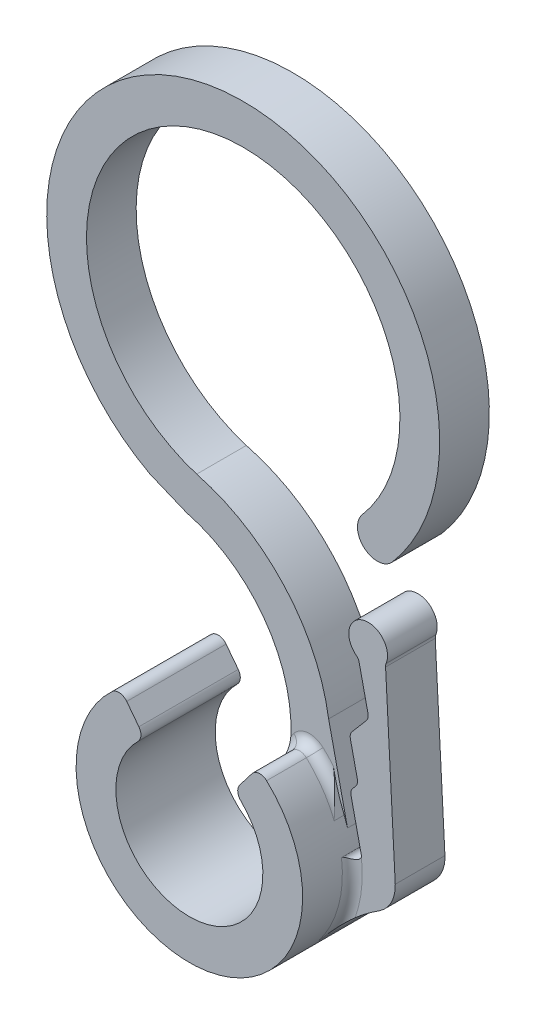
ISO-10303-21;
HEADER;
FILE_DESCRIPTION(('STEP AP214'),'2;1');
FILE_NAME('part.step','',(''),(''),'','','');
FILE_SCHEMA(('AUTOMOTIVE_DESIGN { 1 0 10303 214 1 1 1 1 }'));
ENDSEC;
DATA;
#1=APPLICATION_CONTEXT('core data for automotive mechanical design processes');
#2=APPLICATION_PROTOCOL_DEFINITION('international standard','automotive_design',2000,#1);
#3=PRODUCT_CONTEXT('',#1,'mechanical');
#4=PRODUCT('Part','Part','',(#3));
#5=PRODUCT_RELATED_PRODUCT_CATEGORY('part','',(#4));
#6=PRODUCT_DEFINITION_FORMATION('','',#4);
#7=PRODUCT_DEFINITION_CONTEXT('part definition',#1,'design');
#8=PRODUCT_DEFINITION('design','',#6,#7);
#9=PRODUCT_DEFINITION_SHAPE('','',#8);
#10=(LENGTH_UNIT() NAMED_UNIT(*) SI_UNIT(.MILLI.,.METRE.));
#11=(NAMED_UNIT(*) PLANE_ANGLE_UNIT() SI_UNIT($,.RADIAN.));
#12=(NAMED_UNIT(*) SI_UNIT($,.STERADIAN.) SOLID_ANGLE_UNIT());
#13=UNCERTAINTY_MEASURE_WITH_UNIT(LENGTH_MEASURE(1.E-05),#10,'distance_accuracy_value','');
#14=(GEOMETRIC_REPRESENTATION_CONTEXT(3) GLOBAL_UNCERTAINTY_ASSIGNED_CONTEXT((#13)) GLOBAL_UNIT_ASSIGNED_CONTEXT((#10,
#11,#12)) REPRESENTATION_CONTEXT('',''));
#15=CARTESIAN_POINT('',(0.,0.,0.));
#16=DIRECTION('',(0.,0.,1.));
#17=DIRECTION('',(1.,0.,0.));
#18=AXIS2_PLACEMENT_3D('',#15,#16,#17);
#19=CARTESIAN_POINT('',(0.,0.,5.));
#20=DIRECTION('',(0.,0.,-1.));
#21=DIRECTION('',(-1.,0.,0.));
#22=AXIS2_PLACEMENT_3D('',#19,#20,#21);
#23=CYLINDRICAL_SURFACE('',#22,5.7);
#24=CARTESIAN_POINT('',(0.,0.,3.));
#25=DIRECTION('',(0.,0.,1.));
#26=DIRECTION('',(1.,0.,0.));
#27=AXIS2_PLACEMENT_3D('',#24,#25,#26);
#28=CIRCLE('',#27,5.7);
#29=CARTESIAN_POINT('',(4.50850965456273,-3.48759812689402,3.));
#30=VERTEX_POINT('',#29);
#31=CARTESIAN_POINT('',(5.65606185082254,0.706374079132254,3.));
#32=VERTEX_POINT('',#31);
#33=EDGE_CURVE('E525',#30,#32,#28,.T.);
#34=ORIENTED_EDGE('',*,*,#33,.T.);
#35=DIRECTION('',(0.,0.,-1.));
#36=VECTOR('',#35,1.);
#37=CARTESIAN_POINT('',(5.65606185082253,0.706374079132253,1.25));
#38=LINE('',#37,#36);
#39=CARTESIAN_POINT('',(5.65606185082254,0.706374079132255,0.));
#40=VERTEX_POINT('',#39);
#41=EDGE_CURVE('E681',#32,#40,#38,.T.);
#42=ORIENTED_EDGE('',*,*,#41,.T.);
#43=CARTESIAN_POINT('',(0.,0.,0.));
#44=DIRECTION('',(0.,0.,1.));
#45=DIRECTION('',(1.,0.,0.));
#46=AXIS2_PLACEMENT_3D('',#43,#44,#45);
#47=CIRCLE('',#46,5.7);
#48=CARTESIAN_POINT('',(5.45853144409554,1.64147326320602,0.));
#49=VERTEX_POINT('',#48);
#50=EDGE_CURVE('E387',#40,#49,#47,.T.);
#51=ORIENTED_EDGE('',*,*,#50,.T.);
#52=DIRECTION('',(0.,0.,-1.));
#53=VECTOR('',#52,1.);
#54=CARTESIAN_POINT('',(5.45853144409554,1.64147326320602,5.));
#55=LINE('',#54,#53);
#56=CARTESIAN_POINT('',(5.45853144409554,1.64147326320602,2.5));
#57=VERTEX_POINT('',#56);
#58=EDGE_CURVE('E680',#49,#57,#55,.F.);
#59=ORIENTED_EDGE('',*,*,#58,.T.);
#60=CARTESIAN_POINT('',(0.,0.,2.5));
#61=DIRECTION('',(0.,0.,1.));
#62=DIRECTION('',(1.,0.,0.));
#63=AXIS2_PLACEMENT_3D('',#60,#61,#62);
#64=CIRCLE('',#63,5.7);
#65=CARTESIAN_POINT('',(5.28966368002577,2.1235484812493,2.5));
#66=VERTEX_POINT('',#65);
#67=EDGE_CURVE('E292',#57,#66,#64,.T.);
#68=ORIENTED_EDGE('',*,*,#67,.T.);
#69=DIRECTION('',(0.,0.,-1.));
#70=VECTOR('',#69,1.);
#71=CARTESIAN_POINT('',(5.28966368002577,2.1235484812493,2.5));
#72=LINE('',#71,#70);
#73=CARTESIAN_POINT('',(5.28966368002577,2.1235484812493,3.));
#74=VERTEX_POINT('',#73);
#75=EDGE_CURVE('E359',#74,#66,#72,.T.);
#76=ORIENTED_EDGE('',*,*,#75,.F.);
#77=CARTESIAN_POINT('',(0.,0.,3.));
#78=DIRECTION('',(0.,0.,1.));
#79=DIRECTION('',(1.,0.,0.));
#80=AXIS2_PLACEMENT_3D('',#77,#78,#79);
#81=CIRCLE('',#80,5.7);
#82=CARTESIAN_POINT('',(3.88695157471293,4.16912550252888,3.));
#83=VERTEX_POINT('',#82);
#84=EDGE_CURVE('E469',#74,#83,#81,.T.);
#85=ORIENTED_EDGE('',*,*,#84,.T.);
#86=DIRECTION('',(0.,0.,-1.));
#87=VECTOR('',#86,1.);
#88=CARTESIAN_POINT('',(3.88695157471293,4.16912550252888,5.));
#89=LINE('',#88,#87);
#90=CARTESIAN_POINT('',(3.88695157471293,4.16912550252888,5.));
#91=VERTEX_POINT('',#90);
#92=EDGE_CURVE('E434',#83,#91,#89,.F.);
#93=ORIENTED_EDGE('',*,*,#92,.T.);
#94=CARTESIAN_POINT('',(0.,0.,5.));
#95=DIRECTION('',(0.,0.,1.));
#96=DIRECTION('',(1.,0.,0.));
#97=AXIS2_PLACEMENT_3D('',#94,#95,#96);
#98=CIRCLE('',#97,5.7);
#99=CARTESIAN_POINT('',(-3.89040931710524,4.16589910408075,5.));
#100=VERTEX_POINT('',#99);
#101=EDGE_CURVE('E391',#100,#91,#98,.T.);
#102=ORIENTED_EDGE('',*,*,#101,.F.);
#103=DIRECTION('',(0.,0.,-1.));
#104=VECTOR('',#103,1.);
#105=CARTESIAN_POINT('',(-3.89040931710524,4.16589910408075,5.));
#106=LINE('',#105,#104);
#107=CARTESIAN_POINT('',(-3.89040931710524,4.16589910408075,0.));
#108=VERTEX_POINT('',#107);
#109=EDGE_CURVE('E437',#100,#108,#106,.T.);
#110=ORIENTED_EDGE('',*,*,#109,.T.);
#111=CARTESIAN_POINT('',(4.50850965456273,-3.48759812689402,0.));
#112=VERTEX_POINT('',#111);
#113=EDGE_CURVE('E396',#108,#112,#47,.T.);
#114=ORIENTED_EDGE('',*,*,#113,.T.);
#115=DIRECTION('',(0.,0.,-1.));
#116=VECTOR('',#115,1.);
#117=CARTESIAN_POINT('',(4.50850965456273,-3.48759812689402,17.4981994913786));
#118=LINE('',#117,#116);
#119=EDGE_CURVE('E735',#30,#112,#118,.T.);
#120=ORIENTED_EDGE('',*,*,#119,.F.);
#121=EDGE_LOOP('',(#34,#42,#51,#59,#68,#76,#85,#93,#102,#110,#114,#120));
#122=FACE_BOUND('',#121,.T.);
#123=ADVANCED_FACE('F43',(#122),#23,.T.);
#124=CARTESIAN_POINT('',(0.,0.,5.));
#125=DIRECTION('',(0.,0.,1.));
#126=DIRECTION('',(1.,0.,0.));
#127=AXIS2_PLACEMENT_3D('',#124,#125,#126);
#128=PLANE('',#127);
#129=CARTESIAN_POINT('',(0.,0.,5.));
#130=DIRECTION('',(0.,0.,1.));
#131=DIRECTION('',(1.,0.,0.));
#132=AXIS2_PLACEMENT_3D('',#129,#130,#131);
#133=CIRCLE('',#132,3.7);
#134=CARTESIAN_POINT('',(-2.5869501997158,2.64531447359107,5.));
#135=VERTEX_POINT('',#134);
#136=CARTESIAN_POINT('',(2.58475451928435,2.64745992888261,5.));
#137=VERTEX_POINT('',#136);
#138=EDGE_CURVE('E383',#135,#137,#133,.T.);
#139=ORIENTED_EDGE('',*,*,#138,.F.);
#140=CARTESIAN_POINT('',(-2.93653806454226,3.00278940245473,5.));
#141=DIRECTION('',(0.,0.,1.));
#142=DIRECTION('',(1.,0.,0.));
#143=AXIS2_PLACEMENT_3D('',#140,#141,#142);
#144=CIRCLE('',#143,0.5);
#145=CARTESIAN_POINT('',(-2.53998769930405,3.30733465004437,5.));
#146=VERTEX_POINT('',#145);
#147=EDGE_CURVE('E415',#135,#146,#144,.T.);
#148=ORIENTED_EDGE('',*,*,#147,.T.);
#149=DIRECTION('',(-0.609090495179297,0.793100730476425,0.));
#150=VECTOR('',#149,1.);
#151=CARTESIAN_POINT('',(0.,0.,5.));
#152=LINE('',#151,#150);
#153=CARTESIAN_POINT('',(-3.15259497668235,4.1050146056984,5.));
#154=VERTEX_POINT('',#153);
#155=EDGE_CURVE('E374',#146,#154,#152,.T.);
#156=ORIENTED_EDGE('',*,*,#155,.T.);
#157=CARTESIAN_POINT('',(-3.54914534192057,3.80046935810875,5.));
#158=DIRECTION('',(0.,0.,1.));
#159=DIRECTION('',(1.,0.,0.));
#160=AXIS2_PLACEMENT_3D('',#157,#158,#159);
#161=CIRCLE('',#160,0.5);
#162=EDGE_CURVE('E412',#154,#100,#161,.T.);
#163=ORIENTED_EDGE('',*,*,#162,.T.);
#164=ORIENTED_EDGE('',*,*,#101,.T.);
#165=CARTESIAN_POINT('',(3.54599091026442,3.80341273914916,5.));
#166=DIRECTION('',(0.,0.,1.));
#167=DIRECTION('',(1.,0.,0.));
#168=AXIS2_PLACEMENT_3D('',#165,#166,#167);
#169=CIRCLE('',#168,0.5);
#170=CARTESIAN_POINT('',(3.14918800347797,4.10762886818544,5.));
#171=VERTEX_POINT('',#170);
#172=EDGE_CURVE('E409',#91,#171,#169,.T.);
#173=ORIENTED_EDGE('',*,*,#172,.T.);
#174=DIRECTION('',(-0.608432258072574,-0.793605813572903,0.));
#175=VECTOR('',#174,1.);
#176=CARTESIAN_POINT('',(0.,0.,5.));
#177=LINE('',#176,#175);
#178=CARTESIAN_POINT('',(2.53724276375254,3.30944091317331,5.));
#179=VERTEX_POINT('',#178);
#180=EDGE_CURVE('E370',#171,#179,#177,.T.);
#181=ORIENTED_EDGE('',*,*,#180,.T.);
#182=CARTESIAN_POINT('',(2.93404567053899,3.00522478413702,5.));
#183=DIRECTION('',(0.,0.,1.));
#184=DIRECTION('',(1.,0.,0.));
#185=AXIS2_PLACEMENT_3D('',#182,#183,#184);
#186=CIRCLE('',#185,0.5);
#187=EDGE_CURVE('E406',#179,#137,#186,.T.);
#188=ORIENTED_EDGE('',*,*,#187,.T.);
#189=EDGE_LOOP('',(#139,#148,#156,#163,#164,#173,#181,#188));
#190=FACE_BOUND('',#189,.T.);
#191=ADVANCED_FACE('F613',(#190),#128,.T.);
#192=CARTESIAN_POINT('',(0.,0.,0.));
#193=DIRECTION('',(0.,0.,1.));
#194=DIRECTION('',(1.,0.,0.));
#195=AXIS2_PLACEMENT_3D('',#192,#193,#194);
#196=PLANE('',#195);
#197=DIRECTION('',(-0.216587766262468,0.976263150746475,0.));
#198=VECTOR('',#197,1.);
#199=CARTESIAN_POINT('',(6.52581749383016,1.44777792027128,0.));
#200=LINE('',#199,#198);
#201=CARTESIAN_POINT('',(5.95563244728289,4.01787068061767,0.));
#202=VERTEX_POINT('',#201);
#203=CARTESIAN_POINT('',(5.60258824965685,5.60920728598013,0.));
#204=VERTEX_POINT('',#203);
#205=EDGE_CURVE('E707',#202,#204,#200,.T.);
#206=ORIENTED_EDGE('',*,*,#205,.T.);
#207=CARTESIAN_POINT('',(5.99309350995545,5.69584239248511,0.));
#208=DIRECTION('',(0.,0.,1.));
#209=DIRECTION('',(1.,0.,0.));
#210=AXIS2_PLACEMENT_3D('',#207,#208,#209);
#211=CIRCLE('',#210,0.4);
#212=CARTESIAN_POINT('',(5.68807163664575,5.95461189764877,0.));
#213=VERTEX_POINT('',#212);
#214=EDGE_CURVE('E856',#204,#213,#211,.F.);
#215=ORIENTED_EDGE('',*,*,#214,.T.);
#216=DIRECTION('',(0.646923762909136,0.762554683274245,0.));
#217=VECTOR('',#216,1.);
#218=CARTESIAN_POINT('',(0.370056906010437,-0.313942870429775,0.));
#219=LINE('',#218,#217);
#220=CARTESIAN_POINT('',(6.40542842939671,6.8001887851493,0.));
#221=VERTEX_POINT('',#220);
#222=EDGE_CURVE('E710',#213,#221,#219,.T.);
#223=ORIENTED_EDGE('',*,*,#222,.T.);
#224=CARTESIAN_POINT('',(6.10040655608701,7.05895829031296,0.));
#225=DIRECTION('',(0.,0.,1.));
#226=DIRECTION('',(1.,0.,0.));
#227=AXIS2_PLACEMENT_3D('',#224,#225,#226);
#228=CIRCLE('',#227,0.4);
#229=CARTESIAN_POINT('',(6.4909118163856,7.14559339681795,0.));
#230=VERTEX_POINT('',#229);
#231=EDGE_CURVE('E828',#221,#230,#228,.T.);
#232=ORIENTED_EDGE('',*,*,#231,.T.);
#233=DIRECTION('',(-0.216587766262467,0.976263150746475,0.));
#234=VECTOR('',#233,1.);
#235=CARTESIAN_POINT('',(7.69733327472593,1.70768323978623,0.));
#236=LINE('',#235,#234);
#237=CARTESIAN_POINT('',(6.04460817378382,9.15729427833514,0.));
#238=VERTEX_POINT('',#237);
#239=EDGE_CURVE('E714',#230,#238,#236,.T.);
#240=ORIENTED_EDGE('',*,*,#239,.T.);
#241=CARTESIAN_POINT('',(5.65410291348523,9.07065917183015,0.));
#242=DIRECTION('',(0.,0.,1.));
#243=DIRECTION('',(1.,0.,0.));
#244=AXIS2_PLACEMENT_3D('',#241,#242,#243);
#245=CIRCLE('',#244,0.4);
#246=CARTESIAN_POINT('',(5.89989754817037,9.38623007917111,0.));
#247=VERTEX_POINT('',#246);
#248=EDGE_CURVE('E822',#238,#247,#245,.T.);
#249=ORIENTED_EDGE('',*,*,#248,.T.);
#250=CARTESIAN_POINT('',(6.49913889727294,10.155584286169,0.));
#251=DIRECTION('',(0.,0.,1.));
#252=DIRECTION('',(1.,0.,0.));
#253=AXIS2_PLACEMENT_3D('',#250,#251,#252);
#254=CIRCLE('',#253,0.975190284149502);
#255=CARTESIAN_POINT('',(7.40280406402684,9.78899820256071,0.));
#256=VERTEX_POINT('',#255);
#257=EDGE_CURVE('E719',#256,#247,#254,.T.);
#258=ORIENTED_EDGE('',*,*,#257,.F.);
#259=CARTESIAN_POINT('',(7.77346615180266,9.63863325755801,0.));
#260=DIRECTION('',(0.,0.,1.));
#261=DIRECTION('',(1.,0.,0.));
#262=AXIS2_PLACEMENT_3D('',#259,#260,#261);
#263=CIRCLE('',#262,0.4);
#264=CARTESIAN_POINT('',(7.3740231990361,9.61753047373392,0.));
#265=VERTEX_POINT('',#264);
#266=EDGE_CURVE('E808',#256,#265,#263,.T.);
#267=ORIENTED_EDGE('',*,*,#266,.T.);
#268=DIRECTION('',(0.0527569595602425,-0.998607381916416,0.));
#269=VECTOR('',#268,1.);
#270=CARTESIAN_POINT('',(7.86018416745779,0.415257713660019,0.));
#271=LINE('',#270,#269);
#272=CARTESIAN_POINT('',(7.86125945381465,0.394904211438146,0.));
#273=VERTEX_POINT('',#272);
#274=EDGE_CURVE('E718',#265,#273,#271,.T.);
#275=ORIENTED_EDGE('',*,*,#274,.T.);
#276=CARTESIAN_POINT('',(6.07569294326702,0.328668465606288,0.));
#277=DIRECTION('',(0.,0.,1.));
#278=DIRECTION('',(1.,0.,0.));
#279=AXIS2_PLACEMENT_3D('',#276,#277,#278);
#280=CIRCLE('',#279,1.78679459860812);
#281=CARTESIAN_POINT('',(7.03716842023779,-1.17738593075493,0.));
#282=VERTEX_POINT('',#281);
#283=EDGE_CURVE('E307',#273,#282,#280,.F.);
#284=ORIENTED_EDGE('',*,*,#283,.T.);
#285=CARTESIAN_POINT('',(12.4181757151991,-9.60619133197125,0.));
#286=DIRECTION('',(0.,0.,1.));
#287=DIRECTION('',(1.,0.,0.));
#288=AXIS2_PLACEMENT_3D('',#285,#286,#287);
#289=CIRCLE('',#288,10.);
#290=EDGE_CURVE('E730',#112,#282,#289,.F.);
#291=ORIENTED_EDGE('',*,*,#290,.F.);
#292=ORIENTED_EDGE('',*,*,#113,.F.);
#293=CARTESIAN_POINT('',(-3.54914534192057,3.80046935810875,0.));
#294=DIRECTION('',(0.,0.,1.));
#295=DIRECTION('',(1.,0.,0.));
#296=AXIS2_PLACEMENT_3D('',#293,#294,#295);
#297=CIRCLE('',#296,0.5);
#298=CARTESIAN_POINT('',(-3.15259497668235,4.1050146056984,0.));
#299=VERTEX_POINT('',#298);
#300=EDGE_CURVE('E428',#108,#299,#297,.F.);
#301=ORIENTED_EDGE('',*,*,#300,.T.);
#302=DIRECTION('',(-0.609090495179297,0.793100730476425,0.));
#303=VECTOR('',#302,1.);
#304=CARTESIAN_POINT('',(0.,0.,0.));
#305=LINE('',#304,#303);
#306=CARTESIAN_POINT('',(-2.53998769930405,3.30733465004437,0.));
#307=VERTEX_POINT('',#306);
#308=EDGE_CURVE('E378',#307,#299,#305,.T.);
#309=ORIENTED_EDGE('',*,*,#308,.F.);
#310=CARTESIAN_POINT('',(-2.93653806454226,3.00278940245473,0.));
#311=DIRECTION('',(0.,0.,1.));
#312=DIRECTION('',(1.,0.,0.));
#313=AXIS2_PLACEMENT_3D('',#310,#311,#312);
#314=CIRCLE('',#313,0.5);
#315=CARTESIAN_POINT('',(-2.5869501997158,2.64531447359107,0.));
#316=VERTEX_POINT('',#315);
#317=EDGE_CURVE('E431',#307,#316,#314,.F.);
#318=ORIENTED_EDGE('',*,*,#317,.T.);
#319=CARTESIAN_POINT('',(0.,0.,0.));
#320=DIRECTION('',(0.,0.,1.));
#321=DIRECTION('',(1.,0.,0.));
#322=AXIS2_PLACEMENT_3D('',#319,#320,#321);
#323=CIRCLE('',#322,3.7);
#324=CARTESIAN_POINT('',(2.58475451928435,2.64745992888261,0.));
#325=VERTEX_POINT('',#324);
#326=EDGE_CURVE('E382',#316,#325,#323,.T.);
#327=ORIENTED_EDGE('',*,*,#326,.T.);
#328=CARTESIAN_POINT('',(2.93404567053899,3.00522478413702,0.));
#329=DIRECTION('',(0.,0.,1.));
#330=DIRECTION('',(1.,0.,0.));
#331=AXIS2_PLACEMENT_3D('',#328,#329,#330);
#332=CIRCLE('',#331,0.5);
#333=CARTESIAN_POINT('',(2.49182029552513,3.23854155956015,0.));
#334=VERTEX_POINT('',#333);
#335=EDGE_CURVE('E425',#325,#334,#332,.F.);
#336=ORIENTED_EDGE('',*,*,#335,.T.);
#337=CARTESIAN_POINT('',(-4.40111221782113,4.54502231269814,0.));
#338=DIRECTION('',(0.,0.,1.));
#339=DIRECTION('',(1.,0.,0.));
#340=AXIS2_PLACEMENT_3D('',#337,#338,#339);
#341=CIRCLE('',#340,7.01565468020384);
#342=CARTESIAN_POINT('',(-2.63576617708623,11.3349386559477,0.));
#343=VERTEX_POINT('',#342);
#344=EDGE_CURVE('E337',#334,#343,#341,.T.);
#345=ORIENTED_EDGE('',*,*,#344,.T.);
#346=DIRECTION('',(0.923994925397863,-0.382404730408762,0.));
#347=VECTOR('',#346,1.);
#348=CARTESIAN_POINT('',(3.61965057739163,8.74607058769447,0.));
#349=LINE('',#348,#347);
#350=CARTESIAN_POINT('',(-4.48375602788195,12.0997481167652,0.));
#351=VERTEX_POINT('',#350);
#352=EDGE_CURVE('E332',#351,#343,#349,.T.);
#353=ORIENTED_EDGE('',*,*,#352,.F.);
#354=CARTESIAN_POINT('',(0.209539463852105,20.8021136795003,0.));
#355=DIRECTION('',(0.,0.,1.));
#356=DIRECTION('',(1.,0.,0.));
#357=AXIS2_PLACEMENT_3D('',#354,#355,#356);
#358=CIRCLE('',#357,9.88727409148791);
#359=CARTESIAN_POINT('',(7.71821264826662,14.3695390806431,0.));
#360=VERTEX_POINT('',#359);
#361=EDGE_CURVE('E328',#351,#360,#358,.F.);
#362=ORIENTED_EDGE('',*,*,#361,.T.);
#363=CARTESIAN_POINT('',(6.95878460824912,15.0201303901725,0.));
#364=DIRECTION('',(0.,0.,1.));
#365=DIRECTION('',(1.,0.,0.));
#366=AXIS2_PLACEMENT_3D('',#363,#364,#365);
#367=CIRCLE('',#366,1.);
#368=CARTESIAN_POINT('',(6.19935656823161,15.6707216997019,0.));
#369=VERTEX_POINT('',#368);
#370=EDGE_CURVE('E346',#369,#360,#367,.T.);
#371=ORIENTED_EDGE('',*,*,#370,.F.);
#372=CARTESIAN_POINT('',(0.209539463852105,20.8021136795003,0.));
#373=DIRECTION('',(0.,0.,1.));
#374=DIRECTION('',(1.,0.,0.));
#375=AXIS2_PLACEMENT_3D('',#372,#373,#374);
#376=CIRCLE('',#375,7.88727409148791);
#377=CARTESIAN_POINT('',(-2.13250707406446,13.270585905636,0.));
#378=VERTEX_POINT('',#377);
#379=EDGE_CURVE('E343',#378,#369,#376,.F.);
#380=ORIENTED_EDGE('',*,*,#379,.F.);
#381=CARTESIAN_POINT('',(-4.40111221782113,4.54502231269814,0.));
#382=DIRECTION('',(0.,0.,1.));
#383=DIRECTION('',(1.,0.,0.));
#384=AXIS2_PLACEMENT_3D('',#381,#382,#383);
#385=CIRCLE('',#384,9.01565468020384);
#386=CARTESIAN_POINT('',(4.50850965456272,5.92366925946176,0.));
#387=VERTEX_POINT('',#386);
#388=EDGE_CURVE('E340',#387,#378,#385,.T.);
#389=ORIENTED_EDGE('',*,*,#388,.F.);
#390=DIRECTION('',(0.216587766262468,-0.976263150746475,0.));
#391=VECTOR('',#390,1.);
#392=CARTESIAN_POINT('',(5.54955434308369,1.23119015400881,0.));
#393=LINE('',#392,#391);
#394=EDGE_CURVE('E303',#387,#49,#393,.T.);
#395=ORIENTED_EDGE('',*,*,#394,.T.);
#396=ORIENTED_EDGE('',*,*,#50,.F.);
#397=CARTESIAN_POINT('',(5.90175883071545,0.79790500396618,0.));
#398=DIRECTION('',(0.,0.,1.));
#399=DIRECTION('',(1.,0.,0.));
#400=AXIS2_PLACEMENT_3D('',#397,#398,#399);
#401=CIRCLE('',#400,0.262192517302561);
#402=CARTESIAN_POINT('',(6.16294041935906,0.774902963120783,0.));
#403=VERTEX_POINT('',#402);
#404=EDGE_CURVE('E689',#40,#403,#401,.T.);
#405=ORIENTED_EDGE('',*,*,#404,.T.);
#406=DIRECTION('',(-0.216587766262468,0.976263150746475,0.));
#407=VECTOR('',#406,1.);
#408=CARTESIAN_POINT('',(6.03768591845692,1.33948403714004,0.));
#409=LINE('',#408,#407);
#410=CARTESIAN_POINT('',(5.63569196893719,3.15146024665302,0.));
#411=VERTEX_POINT('',#410);
#412=EDGE_CURVE('E694',#403,#411,#409,.T.);
#413=ORIENTED_EDGE('',*,*,#412,.T.);
#414=CARTESIAN_POINT('',(6.02619722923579,3.238095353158,0.));
#415=DIRECTION('',(0.,0.,1.));
#416=DIRECTION('',(1.,0.,0.));
#417=AXIS2_PLACEMENT_3D('',#414,#415,#416);
#418=CIRCLE('',#417,0.4);
#419=CARTESIAN_POINT('',(5.72117535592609,3.49686485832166,0.));
#420=VERTEX_POINT('',#419);
#421=EDGE_CURVE('E801',#411,#420,#418,.F.);
#422=ORIENTED_EDGE('',*,*,#421,.T.);
#423=DIRECTION('',(0.646923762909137,0.762554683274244,0.));
#424=VECTOR('',#423,1.);
#425=CARTESIAN_POINT('',(1.60174923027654,-1.35886600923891,0.));
#426=LINE('',#425,#424);
#427=CARTESIAN_POINT('',(5.870149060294,3.67246606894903,0.));
#428=VERTEX_POINT('',#427);
#429=EDGE_CURVE('E703',#420,#428,#426,.T.);
#430=ORIENTED_EDGE('',*,*,#429,.T.);
#431=CARTESIAN_POINT('',(5.5651271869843,3.93123557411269,0.));
#432=DIRECTION('',(0.,0.,1.));
#433=DIRECTION('',(1.,0.,0.));
#434=AXIS2_PLACEMENT_3D('',#431,#432,#433);
#435=CIRCLE('',#434,0.4);
#436=EDGE_CURVE('E52',#428,#202,#435,.T.);
#437=ORIENTED_EDGE('',*,*,#436,.T.);
#438=EDGE_LOOP('',(#206,#215,#223,#232,#240,#249,#258,#267,#275,#284,#291,#292,#301,#309,#318,
#327,#336,#345,#353,#362,#371,#380,#389,#395,#396,#405,#413,#422,#430,#437));
#439=FACE_BOUND('',#438,.T.);
#440=ADVANCED_FACE('F621',(#439),#196,.F.);
#441=CARTESIAN_POINT('',(0.,0.,5.));
#442=DIRECTION('',(0.,0.,-1.));
#443=DIRECTION('',(-1.,0.,0.));
#444=AXIS2_PLACEMENT_3D('',#441,#442,#443);
#445=CYLINDRICAL_SURFACE('',#444,3.7);
#446=ORIENTED_EDGE('',*,*,#326,.F.);
#447=DIRECTION('',(0.,0.,-1.));
#448=VECTOR('',#447,1.);
#449=CARTESIAN_POINT('',(-2.5869501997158,2.64531447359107,5.));
#450=LINE('',#449,#448);
#451=EDGE_CURVE('E402',#316,#135,#450,.F.);
#452=ORIENTED_EDGE('',*,*,#451,.T.);
#453=ORIENTED_EDGE('',*,*,#138,.T.);
#454=DIRECTION('',(0.,0.,-1.));
#455=VECTOR('',#454,1.);
#456=CARTESIAN_POINT('',(2.58475451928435,2.64745992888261,5.));
#457=LINE('',#456,#455);
#458=EDGE_CURVE('E395',#137,#325,#457,.T.);
#459=ORIENTED_EDGE('',*,*,#458,.T.);
#460=EDGE_LOOP('',(#446,#452,#453,#459));
#461=FACE_BOUND('',#460,.T.);
#462=ADVANCED_FACE('F938',(#461),#445,.F.);
#463=CARTESIAN_POINT('',(0.,0.,-1.2E-05));
#464=DIRECTION('',(0.793100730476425,0.609090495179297,0.));
#465=DIRECTION('',(-0.609090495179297,0.793100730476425,0.));
#466=AXIS2_PLACEMENT_3D('',#463,#464,#465);
#467=PLANE('',#466);
#468=ORIENTED_EDGE('',*,*,#155,.F.);
#469=DIRECTION('',(0.,0.,-1.));
#470=VECTOR('',#469,1.);
#471=CARTESIAN_POINT('',(-2.53998769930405,3.30733465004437,-1.2E-05));
#472=LINE('',#471,#470);
#473=EDGE_CURVE('E422',#146,#307,#472,.T.);
#474=ORIENTED_EDGE('',*,*,#473,.T.);
#475=ORIENTED_EDGE('',*,*,#308,.T.);
#476=DIRECTION('',(0.,0.,1.));
#477=VECTOR('',#476,1.);
#478=CARTESIAN_POINT('',(-3.15259497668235,4.1050146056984,5.));
#479=LINE('',#478,#477);
#480=EDGE_CURVE('E418',#299,#154,#479,.T.);
#481=ORIENTED_EDGE('',*,*,#480,.T.);
#482=EDGE_LOOP('',(#468,#474,#475,#481));
#483=FACE_BOUND('',#482,.T.);
#484=ADVANCED_FACE('F933',(#483),#467,.T.);
#485=CARTESIAN_POINT('',(0.,0.,-1.2E-05));
#486=DIRECTION('',(-0.793605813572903,0.608432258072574,0.));
#487=DIRECTION('',(-0.608432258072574,-0.793605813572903,0.));
#488=AXIS2_PLACEMENT_3D('',#485,#486,#487);
#489=PLANE('',#488);
#490=DIRECTION('',(0.,0.,1.));
#491=VECTOR('',#490,1.);
#492=CARTESIAN_POINT('',(3.14918800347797,4.10762886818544,0.));
#493=LINE('',#492,#491);
#494=CARTESIAN_POINT('',(3.14918800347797,4.10762886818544,3.));
#495=VERTEX_POINT('',#494);
#496=EDGE_CURVE('E443',#171,#495,#493,.F.);
#497=ORIENTED_EDGE('',*,*,#496,.T.);
#498=DIRECTION('',(0.608432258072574,0.793605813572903,0.));
#499=VECTOR('',#498,1.);
#500=CARTESIAN_POINT('',(2.53724276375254,3.30944091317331,3.));
#501=LINE('',#500,#499);
#502=CARTESIAN_POINT('',(2.53724276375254,3.30944091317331,3.));
#503=VERTEX_POINT('',#502);
#504=EDGE_CURVE('E463',#495,#503,#501,.F.);
#505=ORIENTED_EDGE('',*,*,#504,.T.);
#506=DIRECTION('',(0.,0.,-1.));
#507=VECTOR('',#506,1.);
#508=CARTESIAN_POINT('',(2.53724276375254,3.30944091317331,-1.2E-05));
#509=LINE('',#508,#507);
#510=EDGE_CURVE('E440',#503,#179,#509,.F.);
#511=ORIENTED_EDGE('',*,*,#510,.T.);
#512=ORIENTED_EDGE('',*,*,#180,.F.);
#513=EDGE_LOOP('',(#497,#505,#511,#512));
#514=FACE_BOUND('',#513,.T.);
#515=ADVANCED_FACE('F631',(#514),#489,.T.);
#516=CARTESIAN_POINT('',(-2.93653806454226,3.00278940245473,5.));
#517=DIRECTION('',(0.,0.,-1.));
#518=DIRECTION('',(-1.,0.,0.));
#519=AXIS2_PLACEMENT_3D('',#516,#517,#518);
#520=CYLINDRICAL_SURFACE('',#519,0.5);
#521=ORIENTED_EDGE('',*,*,#317,.F.);
#522=ORIENTED_EDGE('',*,*,#473,.F.);
#523=ORIENTED_EDGE('',*,*,#147,.F.);
#524=ORIENTED_EDGE('',*,*,#451,.F.);
#525=EDGE_LOOP('',(#521,#522,#523,#524));
#526=FACE_BOUND('',#525,.T.);
#527=ADVANCED_FACE('F627',(#526),#520,.T.);
#528=CARTESIAN_POINT('',(-3.54914534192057,3.80046935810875,5.));
#529=DIRECTION('',(0.,0.,-1.));
#530=DIRECTION('',(-1.,0.,0.));
#531=AXIS2_PLACEMENT_3D('',#528,#529,#530);
#532=CYLINDRICAL_SURFACE('',#531,0.5);
#533=ORIENTED_EDGE('',*,*,#300,.F.);
#534=ORIENTED_EDGE('',*,*,#109,.F.);
#535=ORIENTED_EDGE('',*,*,#162,.F.);
#536=ORIENTED_EDGE('',*,*,#480,.F.);
#537=EDGE_LOOP('',(#533,#534,#535,#536));
#538=FACE_BOUND('',#537,.T.);
#539=ADVANCED_FACE('F630',(#538),#532,.T.);
#540=CARTESIAN_POINT('',(3.54599091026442,3.80341273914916,5.));
#541=DIRECTION('',(0.,0.,-1.));
#542=DIRECTION('',(-1.,0.,0.));
#543=AXIS2_PLACEMENT_3D('',#540,#541,#542);
#544=CYLINDRICAL_SURFACE('',#543,0.5);
#545=ORIENTED_EDGE('',*,*,#92,.F.);
#546=CARTESIAN_POINT('',(3.54599091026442,3.80341273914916,3.));
#547=DIRECTION('',(0.,0.,1.));
#548=DIRECTION('',(1.,0.,0.));
#549=AXIS2_PLACEMENT_3D('',#546,#547,#548);
#550=CIRCLE('',#549,0.5);
#551=EDGE_CURVE('E466',#83,#495,#550,.T.);
#552=ORIENTED_EDGE('',*,*,#551,.T.);
#553=ORIENTED_EDGE('',*,*,#496,.F.);
#554=ORIENTED_EDGE('',*,*,#172,.F.);
#555=EDGE_LOOP('',(#545,#552,#553,#554));
#556=FACE_BOUND('',#555,.T.);
#557=ADVANCED_FACE('F634',(#556),#544,.T.);
#558=CARTESIAN_POINT('',(2.93404567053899,3.00522478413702,5.));
#559=DIRECTION('',(0.,0.,-1.));
#560=DIRECTION('',(-1.,0.,0.));
#561=AXIS2_PLACEMENT_3D('',#558,#559,#560);
#562=CYLINDRICAL_SURFACE('',#561,0.5);
#563=ORIENTED_EDGE('',*,*,#510,.F.);
#564=CARTESIAN_POINT('',(2.93404567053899,3.00522478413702,3.));
#565=DIRECTION('',(0.,0.,1.));
#566=DIRECTION('',(1.,0.,0.));
#567=AXIS2_PLACEMENT_3D('',#564,#565,#566);
#568=CIRCLE('',#567,0.5);
#569=CARTESIAN_POINT('',(2.49182029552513,3.23854155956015,3.));
#570=VERTEX_POINT('',#569);
#571=EDGE_CURVE('E450',#503,#570,#568,.T.);
#572=ORIENTED_EDGE('',*,*,#571,.T.);
#573=DIRECTION('',(0.,0.,-1.));
#574=VECTOR('',#573,1.);
#575=CARTESIAN_POINT('',(2.49182029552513,3.23854155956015,1.25));
#576=LINE('',#575,#574);
#577=EDGE_CURVE('E447',#334,#570,#576,.F.);
#578=ORIENTED_EDGE('',*,*,#577,.F.);
#579=ORIENTED_EDGE('',*,*,#335,.F.);
#580=ORIENTED_EDGE('',*,*,#458,.F.);
#581=ORIENTED_EDGE('',*,*,#187,.F.);
#582=EDGE_LOOP('',(#563,#572,#578,#579,#580,#581));
#583=FACE_BOUND('',#582,.T.);
#584=ADVANCED_FACE('F498',(#583),#562,.T.);
#585=CARTESIAN_POINT('',(0.,0.,2.5));
#586=DIRECTION('',(0.,0.,1.));
#587=DIRECTION('',(1.,0.,0.));
#588=AXIS2_PLACEMENT_3D('',#585,#586,#587);
#589=PLANE('',#588);
#590=CARTESIAN_POINT('',(0.,0.,2.5));
#591=DIRECTION('',(0.,0.,1.));
#592=DIRECTION('',(1.,0.,0.));
#593=AXIS2_PLACEMENT_3D('',#590,#591,#592);
#594=CIRCLE('',#593,6.2);
#595=CARTESIAN_POINT('',(4.22791223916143,4.53483826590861,2.5));
#596=VERTEX_POINT('',#595);
#597=CARTESIAN_POINT('',(4.74369310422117,3.99216429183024,2.5));
#598=VERTEX_POINT('',#597);
#599=EDGE_CURVE('E454',#596,#598,#594,.F.);
#600=ORIENTED_EDGE('',*,*,#599,.T.);
#601=CARTESIAN_POINT('',(14.5697753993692,5.84907213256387,2.5));
#602=DIRECTION('',(0.,0.,1.));
#603=DIRECTION('',(1.,0.,0.));
#604=AXIS2_PLACEMENT_3D('',#601,#602,#603);
#605=CIRCLE('',#604,10.);
#606=EDGE_CURVE('E734',#66,#598,#605,.F.);
#607=ORIENTED_EDGE('',*,*,#606,.F.);
#608=ORIENTED_EDGE('',*,*,#67,.F.);
#609=DIRECTION('',(0.216587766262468,-0.976263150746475,0.));
#610=VECTOR('',#609,1.);
#611=CARTESIAN_POINT('',(5.54955434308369,1.23119015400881,2.5));
#612=LINE('',#611,#610);
#613=CARTESIAN_POINT('',(4.50850965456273,5.92366925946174,2.5));
#614=VERTEX_POINT('',#613);
#615=EDGE_CURVE('E285',#614,#57,#612,.T.);
#616=ORIENTED_EDGE('',*,*,#615,.F.);
#617=CARTESIAN_POINT('',(-4.40111221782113,4.54502231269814,2.5));
#618=DIRECTION('',(0.,0.,1.));
#619=DIRECTION('',(1.,0.,0.));
#620=AXIS2_PLACEMENT_3D('',#617,#618,#619);
#621=CIRCLE('',#620,9.01565468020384);
#622=CARTESIAN_POINT('',(-2.13250707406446,13.270585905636,2.5));
#623=VERTEX_POINT('',#622);
#624=EDGE_CURVE('E289',#614,#623,#621,.T.);
#625=ORIENTED_EDGE('',*,*,#624,.T.);
#626=CARTESIAN_POINT('',(0.209539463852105,20.8021136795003,2.5));
#627=DIRECTION('',(0.,0.,1.));
#628=DIRECTION('',(1.,0.,0.));
#629=AXIS2_PLACEMENT_3D('',#626,#627,#628);
#630=CIRCLE('',#629,7.88727409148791);
#631=CARTESIAN_POINT('',(6.19935656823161,15.6707216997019,2.5));
#632=VERTEX_POINT('',#631);
#633=EDGE_CURVE('E314',#623,#632,#630,.F.);
#634=ORIENTED_EDGE('',*,*,#633,.T.);
#635=CARTESIAN_POINT('',(6.95878460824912,15.0201303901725,2.5));
#636=DIRECTION('',(0.,0.,1.));
#637=DIRECTION('',(1.,0.,0.));
#638=AXIS2_PLACEMENT_3D('',#635,#636,#637);
#639=CIRCLE('',#638,1.);
#640=CARTESIAN_POINT('',(7.71821264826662,14.3695390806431,2.5));
#641=VERTEX_POINT('',#640);
#642=EDGE_CURVE('E319',#632,#641,#639,.T.);
#643=ORIENTED_EDGE('',*,*,#642,.T.);
#644=CARTESIAN_POINT('',(0.209539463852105,20.8021136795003,2.5));
#645=DIRECTION('',(0.,0.,1.));
#646=DIRECTION('',(1.,0.,0.));
#647=AXIS2_PLACEMENT_3D('',#644,#645,#646);
#648=CIRCLE('',#647,9.88727409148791);
#649=CARTESIAN_POINT('',(-4.48375602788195,12.0997481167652,2.5));
#650=VERTEX_POINT('',#649);
#651=EDGE_CURVE('E350',#650,#641,#648,.F.);
#652=ORIENTED_EDGE('',*,*,#651,.F.);
#653=DIRECTION('',(0.923994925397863,-0.382404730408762,0.));
#654=VECTOR('',#653,1.);
#655=CARTESIAN_POINT('',(3.61965057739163,8.74607058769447,2.5));
#656=LINE('',#655,#654);
#657=CARTESIAN_POINT('',(-2.63576617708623,11.3349386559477,2.5));
#658=VERTEX_POINT('',#657);
#659=EDGE_CURVE('E321',#650,#658,#656,.T.);
#660=ORIENTED_EDGE('',*,*,#659,.T.);
#661=CARTESIAN_POINT('',(-4.40111221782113,4.54502231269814,2.5));
#662=DIRECTION('',(0.,0.,1.));
#663=DIRECTION('',(1.,0.,0.));
#664=AXIS2_PLACEMENT_3D('',#661,#662,#663);
#665=CIRCLE('',#664,7.01565468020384);
#666=CARTESIAN_POINT('',(2.60711899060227,4.22236782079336,2.5));
#667=VERTEX_POINT('',#666);
#668=EDGE_CURVE('E315',#667,#658,#665,.T.);
#669=ORIENTED_EDGE('',*,*,#668,.F.);
#670=DIRECTION('',(0.608432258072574,0.793605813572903,0.));
#671=VECTOR('',#670,1.);
#672=CARTESIAN_POINT('',(2.75238509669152,4.41184499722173,2.5));
#673=LINE('',#672,#671);
#674=CARTESIAN_POINT('',(2.75238509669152,4.41184499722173,2.5));
#675=VERTEX_POINT('',#674);
#676=EDGE_CURVE('E460',#667,#675,#673,.T.);
#677=ORIENTED_EDGE('',*,*,#676,.T.);
#678=CARTESIAN_POINT('',(3.54599091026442,3.80341273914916,2.5));
#679=DIRECTION('',(0.,0.,1.));
#680=DIRECTION('',(1.,0.,0.));
#681=AXIS2_PLACEMENT_3D('',#678,#679,#680);
#682=CIRCLE('',#681,1.);
#683=EDGE_CURVE('E457',#675,#596,#682,.F.);
#684=ORIENTED_EDGE('',*,*,#683,.T.);
#685=EDGE_LOOP('',(#600,#607,#608,#616,#625,#634,#643,#652,#660,#669,#677,#684));
#686=FACE_BOUND('',#685,.T.);
#687=ADVANCED_FACE('F287',(#686),#589,.T.);
#688=CARTESIAN_POINT('',(0.209539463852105,20.8021136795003,2.5));
#689=DIRECTION('',(0.,0.,-1.));
#690=DIRECTION('',(-1.,0.,0.));
#691=AXIS2_PLACEMENT_3D('',#688,#689,#690);
#692=CYLINDRICAL_SURFACE('',#691,9.88727409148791);
#693=ORIENTED_EDGE('',*,*,#361,.F.);
#694=DIRECTION('',(0.,0.,-1.));
#695=VECTOR('',#694,1.);
#696=CARTESIAN_POINT('',(-4.48375602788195,12.0997481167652,2.5));
#697=LINE('',#696,#695);
#698=EDGE_CURVE('E367',#650,#351,#697,.T.);
#699=ORIENTED_EDGE('',*,*,#698,.F.);
#700=ORIENTED_EDGE('',*,*,#651,.T.);
#701=DIRECTION('',(0.,0.,-1.));
#702=VECTOR('',#701,1.);
#703=CARTESIAN_POINT('',(7.71821264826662,14.3695390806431,2.5));
#704=LINE('',#703,#702);
#705=EDGE_CURVE('E327',#641,#360,#704,.T.);
#706=ORIENTED_EDGE('',*,*,#705,.T.);
#707=EDGE_LOOP('',(#693,#699,#700,#706));
#708=FACE_BOUND('',#707,.T.);
#709=ADVANCED_FACE('F544',(#708),#692,.T.);
#710=CARTESIAN_POINT('',(3.61965057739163,8.74607058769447,2.5));
#711=DIRECTION('',(0.382404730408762,0.923994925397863,0.));
#712=DIRECTION('',(-0.923994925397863,0.382404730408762,0.));
#713=AXIS2_PLACEMENT_3D('',#710,#711,#712);
#714=PLANE('',#713);
#715=ORIENTED_EDGE('',*,*,#352,.T.);
#716=DIRECTION('',(0.,0.,-1.));
#717=VECTOR('',#716,1.);
#718=CARTESIAN_POINT('',(-2.63576617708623,11.3349386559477,2.5));
#719=LINE('',#718,#717);
#720=EDGE_CURVE('E363',#658,#343,#719,.T.);
#721=ORIENTED_EDGE('',*,*,#720,.F.);
#722=ORIENTED_EDGE('',*,*,#659,.F.);
#723=ORIENTED_EDGE('',*,*,#698,.T.);
#724=EDGE_LOOP('',(#715,#721,#722,#723));
#725=FACE_BOUND('',#724,.T.);
#726=ADVANCED_FACE('F945',(#725),#714,.F.);
#727=CARTESIAN_POINT('',(-4.40111221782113,4.54502231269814,2.5));
#728=DIRECTION('',(0.,0.,-1.));
#729=DIRECTION('',(-1.,0.,0.));
#730=AXIS2_PLACEMENT_3D('',#727,#728,#729);
#731=CYLINDRICAL_SURFACE('',#730,7.01565468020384);
#732=ORIENTED_EDGE('',*,*,#344,.F.);
#733=ORIENTED_EDGE('',*,*,#577,.T.);
#734=CARTESIAN_POINT('',(2.5087536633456,3.33128259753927,2.81396340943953));
#735=CARTESIAN_POINT('',(2.50772860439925,3.32544694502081,2.82079345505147));
#736=CARTESIAN_POINT('',(2.50671550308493,3.31972286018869,2.82771597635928));
#737=CARTESIAN_POINT('',(2.50472080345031,3.30852988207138,2.84179372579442));
#738=CARTESIAN_POINT('',(2.50373928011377,3.30306158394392,2.8489494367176));
#739=CARTESIAN_POINT('',(2.50079599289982,3.28677107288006,2.87128013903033));
#740=CARTESIAN_POINT('',(2.49890578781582,3.27646195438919,2.88686486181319));
#741=CARTESIAN_POINT('',(2.4962578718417,3.26216387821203,2.91266472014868));
#742=CARTESIAN_POINT('',(2.49535754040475,3.25733689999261,2.92239282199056));
#743=CARTESIAN_POINT('',(2.49380624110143,3.24905654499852,2.94231155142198));
#744=CARTESIAN_POINT('',(2.49315205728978,3.24558542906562,2.95249411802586));
#745=CARTESIAN_POINT('',(2.49229973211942,3.24107168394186,2.97125396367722));
#746=CARTESIAN_POINT('',(2.49203620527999,3.23968035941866,2.97974056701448));
#747=CARTESIAN_POINT('',(2.49177565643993,3.23830655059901,2.99699169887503));
#748=CARTESIAN_POINT('',(2.49178390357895,3.23835192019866,3.00575842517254));
#749=CARTESIAN_POINT('',(2.49195278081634,3.23924073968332,3.01447421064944));
#750=B_SPLINE_CURVE_WITH_KNOTS('',3,(#734,#735,#736,#737,#738,#739,#740,#741,#742,#743,#744,
#745,#746,#747,#748,#749),.UNSPECIFIED.,.F.,.F.,(4,2,2,2,2,2,2,4),(0.,0.0271162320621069,
0.054292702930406,0.110467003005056,0.143098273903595,0.175287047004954,0.200980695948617,
0.227172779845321),.UNSPECIFIED.);
#751=CARTESIAN_POINT('',(2.5087536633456,3.33128259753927,2.81396340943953));
#752=VERTEX_POINT('',#751);
#753=EDGE_CURVE('E472',#570,#752,#750,.F.);
#754=ORIENTED_EDGE('',*,*,#753,.T.);
#755=CARTESIAN_POINT('',(2.60711899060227,4.22236782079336,2.5));
#756=CARTESIAN_POINT('',(2.60517248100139,4.18001845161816,2.50002260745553));
#757=CARTESIAN_POINT('',(2.60283624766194,4.13769713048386,2.5017602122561));
#758=CARTESIAN_POINT('',(2.59741750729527,4.05332198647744,2.50855633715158));
#759=CARTESIAN_POINT('',(2.59433418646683,4.01126850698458,2.51361848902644));
#760=CARTESIAN_POINT('',(2.58746104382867,3.9277607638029,2.52694985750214));
#761=CARTESIAN_POINT('',(2.58367167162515,3.8863061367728,2.5352170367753));
#762=CARTESIAN_POINT('',(2.57544812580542,3.80427088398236,2.55501279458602));
#763=CARTESIAN_POINT('',(2.5710143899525,3.76368968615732,2.56653916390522));
#764=CARTESIAN_POINT('',(2.5617113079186,3.68476784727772,2.5927464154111));
#765=CARTESIAN_POINT('',(2.55685601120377,3.64639644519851,2.60733903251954));
#766=CARTESIAN_POINT('',(2.54673309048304,3.57121868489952,2.64034993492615));
#767=CARTESIAN_POINT('',(2.54146436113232,3.53441695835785,2.65877870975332));
#768=CARTESIAN_POINT('',(2.5317008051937,3.46966426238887,2.69668072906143));
#769=CARTESIAN_POINT('',(2.52723000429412,3.44128437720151,2.71542014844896));
#770=CARTESIAN_POINT('',(2.51847247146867,3.38766254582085,2.75674531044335));
#771=CARTESIAN_POINT('',(2.51418451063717,3.36239628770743,2.77929749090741));
#772=CARTESIAN_POINT('',(2.50829893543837,3.32864321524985,2.81661720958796));
#773=CARTESIAN_POINT('',(2.50644220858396,3.31815817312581,2.82951022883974));
#774=CARTESIAN_POINT('',(2.50299125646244,3.29888252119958,2.85670612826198));
#775=CARTESIAN_POINT('',(2.50139959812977,3.29010835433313,2.87102086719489));
#776=CARTESIAN_POINT('',(2.50000787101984,3.28250414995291,2.8860375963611));
#777=B_SPLINE_CURVE_WITH_KNOTS('',3,(#755,#756,#757,#758,#759,#760,#761,#762,#763,#764,#765,
#766,#767,#768,#769,#770,#771,#772,#773,#774,#775,#776),.UNSPECIFIED.,.F.,.F.,(4,2,2,2,2,2,2,2,
2,2,4),(0.,0.127132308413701,0.254403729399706,0.381594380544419,0.50869902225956,
0.632551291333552,0.756746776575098,0.859430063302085,0.961252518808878,1.01128722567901,
1.0617813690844),.UNSPECIFIED.);
#778=EDGE_CURVE('E481',#752,#667,#777,.F.);
#779=ORIENTED_EDGE('',*,*,#778,.T.);
#780=ORIENTED_EDGE('',*,*,#668,.T.);
#781=ORIENTED_EDGE('',*,*,#720,.T.);
#782=EDGE_LOOP('',(#732,#733,#754,#779,#780,#781));
#783=FACE_BOUND('',#782,.T.);
#784=ADVANCED_FACE('F488',(#783),#731,.F.);
#785=CARTESIAN_POINT('',(14.5697753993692,5.84907213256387,2.5));
#786=DIRECTION('',(0.,0.,-1.));
#787=DIRECTION('',(-1.,0.,0.));
#788=AXIS2_PLACEMENT_3D('',#785,#786,#787);
#789=CYLINDRICAL_SURFACE('',#788,10.);
#790=ORIENTED_EDGE('',*,*,#75,.T.);
#791=ORIENTED_EDGE('',*,*,#606,.T.);
#792=CARTESIAN_POINT('',(4.74369310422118,3.99216429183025,2.5));
#793=CARTESIAN_POINT('',(4.7506850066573,3.95516351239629,2.50000677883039));
#794=CARTESIAN_POINT('',(4.75788381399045,3.91821770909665,2.50102300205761));
#795=CARTESIAN_POINT('',(4.77267522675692,3.8445177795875,2.50483338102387));
#796=CARTESIAN_POINT('',(4.78026759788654,3.80776355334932,2.50762648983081));
#797=CARTESIAN_POINT('',(4.80357627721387,3.69804085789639,2.51829314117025));
#798=CARTESIAN_POINT('',(4.81986159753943,3.62541449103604,2.5284566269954));
#799=CARTESIAN_POINT('',(4.8537115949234,3.48190021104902,2.55336605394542));
#800=CARTESIAN_POINT('',(4.87126546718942,3.41100322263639,2.56807614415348));
#801=CARTESIAN_POINT('',(4.90771276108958,3.27034627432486,2.60106623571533));
#802=CARTESIAN_POINT('',(4.92660719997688,3.20058722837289,2.61934896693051));
#803=CARTESIAN_POINT('',(4.97044028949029,3.04536716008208,2.66342163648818));
#804=CARTESIAN_POINT('',(4.99573042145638,2.96021882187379,2.68995555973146));
#805=CARTESIAN_POINT('',(5.04827165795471,2.79149633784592,2.7459485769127));
#806=CARTESIAN_POINT('',(5.07552331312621,2.70792264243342,2.77540849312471));
#807=CARTESIAN_POINT('',(5.16030719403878,2.4589792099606,2.86664979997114));
#808=CARTESIAN_POINT('',(5.22079937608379,2.29563001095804,2.93121703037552));
#809=CARTESIAN_POINT('',(5.28685961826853,2.13053901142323,2.99720486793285));
#810=CARTESIAN_POINT('',(5.2882606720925,2.12704334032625,2.99860244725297));
#811=CARTESIAN_POINT('',(5.28966368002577,2.1235484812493,3.));
#812=B_SPLINE_CURVE_WITH_KNOTS('',3,(#792,#793,#794,#795,#796,#797,#798,#799,#800,#801,#802,
#803,#804,#805,#806,#807,#808,#809,#810,#811),.UNSPECIFIED.,.F.,.F.,(4,2,2,2,2,2,2,2,2,4),(0.,
0.112928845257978,0.225791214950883,0.450913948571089,0.674304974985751,0.897867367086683,
1.17586652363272,1.45394402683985,2.01088816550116,2.02293901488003),.UNSPECIFIED.);
#813=EDGE_CURVE('E517',#598,#74,#812,.T.);
#814=ORIENTED_EDGE('',*,*,#813,.T.);
#815=EDGE_LOOP('',(#790,#791,#814));
#816=FACE_BOUND('',#815,.T.);
#817=ADVANCED_FACE('F528',(#816),#789,.F.);
#818=CARTESIAN_POINT('',(-4.40111221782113,4.54502231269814,2.5));
#819=DIRECTION('',(0.,0.,-1.));
#820=DIRECTION('',(-1.,0.,0.));
#821=AXIS2_PLACEMENT_3D('',#818,#819,#820);
#822=CYLINDRICAL_SURFACE('',#821,9.01565468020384);
#823=ORIENTED_EDGE('',*,*,#624,.F.);
#824=DIRECTION('',(0.,0.,-1.));
#825=VECTOR('',#824,1.);
#826=CARTESIAN_POINT('',(4.50850965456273,5.92366925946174,17.4981994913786));
#827=LINE('',#826,#825);
#828=EDGE_CURVE('E298',#614,#387,#827,.T.);
#829=ORIENTED_EDGE('',*,*,#828,.T.);
#830=ORIENTED_EDGE('',*,*,#388,.T.);
#831=DIRECTION('',(0.,0.,-1.));
#832=VECTOR('',#831,1.);
#833=CARTESIAN_POINT('',(-2.13250707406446,13.270585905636,2.5));
#834=LINE('',#833,#832);
#835=EDGE_CURVE('E311',#623,#378,#834,.T.);
#836=ORIENTED_EDGE('',*,*,#835,.F.);
#837=EDGE_LOOP('',(#823,#829,#830,#836));
#838=FACE_BOUND('',#837,.T.);
#839=ADVANCED_FACE('F309',(#838),#822,.T.);
#840=CARTESIAN_POINT('',(0.209539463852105,20.8021136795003,2.5));
#841=DIRECTION('',(0.,0.,-1.));
#842=DIRECTION('',(-1.,0.,0.));
#843=AXIS2_PLACEMENT_3D('',#840,#841,#842);
#844=CYLINDRICAL_SURFACE('',#843,7.88727409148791);
#845=ORIENTED_EDGE('',*,*,#379,.T.);
#846=DIRECTION('',(0.,0.,-1.));
#847=VECTOR('',#846,1.);
#848=CARTESIAN_POINT('',(6.19935656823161,15.6707216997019,2.5));
#849=LINE('',#848,#847);
#850=EDGE_CURVE('E353',#632,#369,#849,.T.);
#851=ORIENTED_EDGE('',*,*,#850,.F.);
#852=ORIENTED_EDGE('',*,*,#633,.F.);
#853=ORIENTED_EDGE('',*,*,#835,.T.);
#854=EDGE_LOOP('',(#845,#851,#852,#853));
#855=FACE_BOUND('',#854,.T.);
#856=ADVANCED_FACE('F535',(#855),#844,.F.);
#857=CARTESIAN_POINT('',(6.95878460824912,15.0201303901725,2.5));
#858=DIRECTION('',(0.,0.,-1.));
#859=DIRECTION('',(-1.,0.,0.));
#860=AXIS2_PLACEMENT_3D('',#857,#858,#859);
#861=CYLINDRICAL_SURFACE('',#860,1.);
#862=ORIENTED_EDGE('',*,*,#370,.T.);
#863=ORIENTED_EDGE('',*,*,#705,.F.);
#864=ORIENTED_EDGE('',*,*,#642,.F.);
#865=ORIENTED_EDGE('',*,*,#850,.T.);
#866=EDGE_LOOP('',(#862,#863,#864,#865));
#867=FACE_BOUND('',#866,.T.);
#868=ADVANCED_FACE('F512',(#867),#861,.T.);
#869=CARTESIAN_POINT('',(0.,0.,3.));
#870=DIRECTION('',(0.,0.,1.));
#871=DIRECTION('',(1.,0.,0.));
#872=AXIS2_PLACEMENT_3D('',#869,#870,#871);
#873=TOROIDAL_SURFACE('',#872,6.2,0.5);
#874=ORIENTED_EDGE('',*,*,#813,.F.);
#875=ORIENTED_EDGE('',*,*,#599,.F.);
#876=CARTESIAN_POINT('',(4.22791223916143,4.53483826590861,3.));
#877=DIRECTION('',(0.731425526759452,-0.681921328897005,0.));
#878=DIRECTION('',(0.681921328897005,0.731425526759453,0.));
#879=AXIS2_PLACEMENT_3D('',#876,#877,#878);
#880=CIRCLE('',#879,0.5);
#881=EDGE_CURVE('E333',#83,#596,#880,.T.);
#882=ORIENTED_EDGE('',*,*,#881,.F.);
#883=ORIENTED_EDGE('',*,*,#84,.F.);
#884=EDGE_LOOP('',(#874,#875,#882,#883));
#885=FACE_BOUND('',#884,.T.);
#886=ADVANCED_FACE('F507',(#885),#873,.F.);
#887=CARTESIAN_POINT('',(3.54599091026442,3.80341273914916,3.));
#888=DIRECTION('',(0.,0.,1.));
#889=DIRECTION('',(1.,0.,0.));
#890=AXIS2_PLACEMENT_3D('',#887,#888,#889);
#891=TOROIDAL_SURFACE('',#890,1.,0.5);
#892=ORIENTED_EDGE('',*,*,#881,.T.);
#893=ORIENTED_EDGE('',*,*,#683,.F.);
#894=CARTESIAN_POINT('',(2.75238509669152,4.41184499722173,3.));
#895=DIRECTION('',(0.608432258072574,0.793605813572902,0.));
#896=DIRECTION('',(-0.793605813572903,0.608432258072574,0.));
#897=AXIS2_PLACEMENT_3D('',#894,#895,#896);
#898=CIRCLE('',#897,0.5);
#899=EDGE_CURVE('E655',#495,#675,#898,.T.);
#900=ORIENTED_EDGE('',*,*,#899,.F.);
#901=ORIENTED_EDGE('',*,*,#551,.F.);
#902=EDGE_LOOP('',(#892,#893,#900,#901));
#903=FACE_BOUND('',#902,.T.);
#904=ADVANCED_FACE('F503',(#903),#891,.F.);
#905=CARTESIAN_POINT('',(-0.396802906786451,0.304216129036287,3.));
#906=DIRECTION('',(-0.608432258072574,-0.793605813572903,0.));
#907=DIRECTION('',(0.793605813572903,-0.608432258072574,0.));
#908=AXIS2_PLACEMENT_3D('',#905,#906,#907);
#909=CYLINDRICAL_SURFACE('',#908,0.5);
#910=ORIENTED_EDGE('',*,*,#676,.F.);
#911=ORIENTED_EDGE('',*,*,#778,.F.);
#912=CARTESIAN_POINT('',(2.14043985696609,3.61365704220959,3.));
#913=DIRECTION('',(0.608432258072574,0.793605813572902,0.));
#914=DIRECTION('',(-0.793605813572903,0.608432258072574,0.));
#915=AXIS2_PLACEMENT_3D('',#912,#913,#914);
#916=CIRCLE('',#915,0.5);
#917=EDGE_CURVE('E526',#503,#752,#916,.T.);
#918=ORIENTED_EDGE('',*,*,#917,.F.);
#919=ORIENTED_EDGE('',*,*,#504,.F.);
#920=ORIENTED_EDGE('',*,*,#899,.T.);
#921=EDGE_LOOP('',(#910,#911,#918,#919,#920));
#922=FACE_BOUND('',#921,.T.);
#923=ADVANCED_FACE('F496',(#922),#909,.F.);
#924=CARTESIAN_POINT('',(2.93404567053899,3.00522478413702,3.));
#925=DIRECTION('',(0.,0.,1.));
#926=DIRECTION('',(1.,0.,0.));
#927=AXIS2_PLACEMENT_3D('',#924,#925,#926);
#928=TOROIDAL_SURFACE('',#927,1.,0.5);
#929=ORIENTED_EDGE('',*,*,#753,.F.);
#930=ORIENTED_EDGE('',*,*,#571,.F.);
#931=ORIENTED_EDGE('',*,*,#917,.T.);
#932=EDGE_LOOP('',(#929,#930,#931));
#933=FACE_BOUND('',#932,.T.);
#934=ADVANCED_FACE('F492',(#933),#928,.F.);
#935=CARTESIAN_POINT('',(5.54955434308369,1.23119015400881,17.4981994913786));
#936=DIRECTION('',(0.976263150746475,0.216587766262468,0.));
#937=DIRECTION('',(-0.216587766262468,0.976263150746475,0.));
#938=AXIS2_PLACEMENT_3D('',#935,#936,#937);
#939=PLANE('',#938);
#940=ORIENTED_EDGE('',*,*,#58,.F.);
#941=ORIENTED_EDGE('',*,*,#394,.F.);
#942=ORIENTED_EDGE('',*,*,#828,.F.);
#943=ORIENTED_EDGE('',*,*,#615,.T.);
#944=EDGE_LOOP('',(#940,#941,#942,#943));
#945=FACE_BOUND('',#944,.T.);
#946=ADVANCED_FACE('F301',(#945),#939,.T.);
#947=CARTESIAN_POINT('',(5.90175883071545,0.79790500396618,17.4981994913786));
#948=DIRECTION('',(0.,0.,-1.));
#949=DIRECTION('',(-1.,0.,0.));
#950=AXIS2_PLACEMENT_3D('',#947,#948,#949);
#951=CYLINDRICAL_SURFACE('',#950,0.262192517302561);
#952=ORIENTED_EDGE('',*,*,#41,.F.);
#953=CARTESIAN_POINT('',(5.65606185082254,0.706374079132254,3.));
#954=CARTESIAN_POINT('',(5.65605648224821,0.706407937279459,2.98969662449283));
#955=CARTESIAN_POINT('',(5.65654803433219,0.705047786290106,2.97961119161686));
#956=CARTESIAN_POINT('',(5.65830260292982,0.700540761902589,2.96006547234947));
#957=CARTESIAN_POINT('',(5.65955249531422,0.697424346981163,2.95059752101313));
#958=CARTESIAN_POINT('',(5.66324566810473,0.688884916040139,2.92832572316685));
#959=CARTESIAN_POINT('',(5.66596841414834,0.683040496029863,2.91575329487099));
#960=CARTESIAN_POINT('',(5.67231944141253,0.670817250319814,2.89109530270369));
#961=CARTESIAN_POINT('',(5.67594928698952,0.664437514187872,2.8790106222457));
#962=CARTESIAN_POINT('',(5.68824786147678,0.644951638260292,2.84282222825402));
#963=CARTESIAN_POINT('',(5.69824312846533,0.631718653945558,2.81922593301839));
#964=CARTESIAN_POINT('',(5.72287703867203,0.605265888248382,2.77077308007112));
#965=CARTESIAN_POINT('',(5.73788050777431,0.592180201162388,2.74602703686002));
#966=CARTESIAN_POINT('',(5.77223409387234,0.569010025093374,2.69838934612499));
#967=CARTESIAN_POINT('',(5.79155003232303,0.558903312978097,2.67548494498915));
#968=CARTESIAN_POINT('',(5.82566119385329,0.546641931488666,2.64128075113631));
#969=CARTESIAN_POINT('',(5.83901675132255,0.542927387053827,2.6291027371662));
#970=CARTESIAN_POINT('',(5.86713435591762,0.537616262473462,2.60594294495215));
#971=CARTESIAN_POINT('',(5.88189524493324,0.536017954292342,2.59496019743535));
#972=CARTESIAN_POINT('',(5.91004204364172,0.535529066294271,2.57618834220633));
#973=CARTESIAN_POINT('',(5.92326633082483,0.536243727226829,2.56816978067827));
#974=CARTESIAN_POINT('',(5.95014287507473,0.539859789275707,2.55343019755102));
#975=CARTESIAN_POINT('',(5.96379492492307,0.542760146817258,2.54670855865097));
#976=CARTESIAN_POINT('',(5.99111454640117,0.550993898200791,2.53467957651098));
#977=CARTESIAN_POINT('',(6.00478164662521,0.556342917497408,2.52938166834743));
#978=CARTESIAN_POINT('',(6.03140207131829,0.569524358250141,2.52029813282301));
#979=CARTESIAN_POINT('',(6.04435574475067,0.577355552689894,2.51651176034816));
#980=CARTESIAN_POINT('',(6.06755452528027,0.594336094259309,2.51066364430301));
#981=CARTESIAN_POINT('',(6.07794079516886,0.603244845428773,2.50845776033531));
#982=CARTESIAN_POINT('',(6.09727095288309,0.622669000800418,2.5049534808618));
#983=CARTESIAN_POINT('',(6.10621418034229,0.633185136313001,2.50365549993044));
#984=CARTESIAN_POINT('',(6.12235951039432,0.655530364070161,2.50173669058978));
#985=CARTESIAN_POINT('',(6.12956129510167,0.667359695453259,2.50111598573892));
#986=CARTESIAN_POINT('',(6.14200640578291,0.691999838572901,2.50030929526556));
#987=CARTESIAN_POINT('',(6.14725293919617,0.704809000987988,2.50012259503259));
#988=CARTESIAN_POINT('',(6.15326000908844,0.723559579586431,2.50001330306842));
#989=CARTESIAN_POINT('',(6.15486986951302,0.729237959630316,2.50000072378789));
#990=CARTESIAN_POINT('',(6.1562839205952,0.734961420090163,2.5));
#991=B_SPLINE_CURVE_WITH_KNOTS('',3,(#953,#954,#955,#956,#957,#958,#959,#960,#961,#962,#963,
#964,#965,#966,#967,#968,#969,#970,#971,#972,#973,#974,#975,#976,#977,#978,#979,#980,#981,#982,
#983,#984,#985,#986,#987,#988,#989,#990),.UNSPECIFIED.,.F.,.F.,(4,2,2,2,2,2,2,2,2,2,2,2,2,2,2,2,
2,2,4),(0.,0.0304888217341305,0.0604644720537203,0.102781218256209,0.145171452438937,
0.231441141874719,0.326352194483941,0.420536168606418,0.475723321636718,0.53086538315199,
0.577123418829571,0.623359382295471,0.669894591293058,0.716406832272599,0.757789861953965,
0.799191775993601,0.840601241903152,0.881942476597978,0.899634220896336),.UNSPECIFIED.);
#992=CARTESIAN_POINT('',(6.1562839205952,0.734961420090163,2.5));
#993=VERTEX_POINT('',#992);
#994=EDGE_CURVE('E556',#32,#993,#991,.T.);
#995=ORIENTED_EDGE('',*,*,#994,.T.);
#996=CARTESIAN_POINT('',(5.90175883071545,0.79790500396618,2.5));
#997=DIRECTION('',(0.,0.,1.));
#998=DIRECTION('',(1.,0.,0.));
#999=AXIS2_PLACEMENT_3D('',#996,#997,#998);
#1000=CIRCLE('',#999,0.262192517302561);
#1001=CARTESIAN_POINT('',(6.16294041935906,0.774902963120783,2.5));
#1002=VERTEX_POINT('',#1001);
#1003=EDGE_CURVE('E297',#993,#1002,#1000,.T.);
#1004=ORIENTED_EDGE('',*,*,#1003,.T.);
#1005=DIRECTION('',(0.,0.,-1.));
#1006=VECTOR('',#1005,1.);
#1007=CARTESIAN_POINT('',(6.16294041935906,0.774902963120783,17.4981994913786));
#1008=LINE('',#1007,#1006);
#1009=EDGE_CURVE('E762',#1002,#403,#1008,.T.);
#1010=ORIENTED_EDGE('',*,*,#1009,.T.);
#1011=ORIENTED_EDGE('',*,*,#404,.F.);
#1012=EDGE_LOOP('',(#952,#995,#1004,#1010,#1011));
#1013=FACE_BOUND('',#1012,.T.);
#1014=ADVANCED_FACE('F548',(#1013),#951,.F.);
#1015=DIRECTION('',(0.646923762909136,0.762554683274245,0.));
#1016=VECTOR('',#1015,1.);
#1017=CARTESIAN_POINT('',(0.370056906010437,-0.313942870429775,2.5));
#1018=LINE('',#1017,#1016);
#1019=CARTESIAN_POINT('',(5.68807163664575,5.95461189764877,2.5));
#1020=VERTEX_POINT('',#1019);
#1021=CARTESIAN_POINT('',(6.40542842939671,6.8001887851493,2.5));
#1022=VERTEX_POINT('',#1021);
#1023=EDGE_CURVE('E749',#1020,#1022,#1018,.T.);
#1024=ORIENTED_EDGE('',*,*,#1023,.F.);
#1025=CARTESIAN_POINT('',(5.99309350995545,5.69584239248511,2.5));
#1026=DIRECTION('',(0.,0.,1.));
#1027=DIRECTION('',(1.,0.,0.));
#1028=AXIS2_PLACEMENT_3D('',#1025,#1026,#1027);
#1029=CIRCLE('',#1028,0.4);
#1030=CARTESIAN_POINT('',(5.60258824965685,5.60920728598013,2.5));
#1031=VERTEX_POINT('',#1030);
#1032=EDGE_CURVE('E861',#1020,#1031,#1029,.T.);
#1033=ORIENTED_EDGE('',*,*,#1032,.T.);
#1034=DIRECTION('',(-0.216587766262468,0.976263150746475,0.));
#1035=VECTOR('',#1034,1.);
#1036=CARTESIAN_POINT('',(6.52581749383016,1.44777792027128,2.5));
#1037=LINE('',#1036,#1035);
#1038=CARTESIAN_POINT('',(5.95563244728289,4.01787068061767,2.5));
#1039=VERTEX_POINT('',#1038);
#1040=EDGE_CURVE('E753',#1039,#1031,#1037,.T.);
#1041=ORIENTED_EDGE('',*,*,#1040,.F.);
#1042=CARTESIAN_POINT('',(5.5651271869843,3.93123557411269,2.5));
#1043=DIRECTION('',(0.,0.,1.));
#1044=DIRECTION('',(1.,0.,0.));
#1045=AXIS2_PLACEMENT_3D('',#1042,#1043,#1044);
#1046=CIRCLE('',#1045,0.4);
#1047=CARTESIAN_POINT('',(5.870149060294,3.67246606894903,2.5));
#1048=VERTEX_POINT('',#1047);
#1049=EDGE_CURVE('E11',#1039,#1048,#1046,.F.);
#1050=ORIENTED_EDGE('',*,*,#1049,.T.);
#1051=DIRECTION('',(0.646923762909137,0.762554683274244,0.));
#1052=VECTOR('',#1051,1.);
#1053=CARTESIAN_POINT('',(1.60174923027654,-1.35886600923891,2.5));
#1054=LINE('',#1053,#1052);
#1055=CARTESIAN_POINT('',(5.72117535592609,3.49686485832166,2.5));
#1056=VERTEX_POINT('',#1055);
#1057=EDGE_CURVE('E757',#1056,#1048,#1054,.T.);
#1058=ORIENTED_EDGE('',*,*,#1057,.F.);
#1059=CARTESIAN_POINT('',(6.02619722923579,3.238095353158,2.5));
#1060=DIRECTION('',(0.,0.,1.));
#1061=DIRECTION('',(1.,0.,0.));
#1062=AXIS2_PLACEMENT_3D('',#1059,#1060,#1061);
#1063=CIRCLE('',#1062,0.4);
#1064=CARTESIAN_POINT('',(5.63569196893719,3.15146024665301,2.5));
#1065=VERTEX_POINT('',#1064);
#1066=EDGE_CURVE('E59',#1056,#1065,#1063,.T.);
#1067=ORIENTED_EDGE('',*,*,#1066,.T.);
#1068=DIRECTION('',(-0.216587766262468,0.976263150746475,0.));
#1069=VECTOR('',#1068,1.);
#1070=CARTESIAN_POINT('',(6.03768591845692,1.33948403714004,2.5));
#1071=LINE('',#1070,#1069);
#1072=EDGE_CURVE('E760',#1002,#1065,#1071,.T.);
#1073=ORIENTED_EDGE('',*,*,#1072,.F.);
#1074=ORIENTED_EDGE('',*,*,#1003,.F.);
#1075=CARTESIAN_POINT('',(0.,0.,2.5));
#1076=DIRECTION('',(0.,0.,1.));
#1077=DIRECTION('',(1.,0.,0.));
#1078=AXIS2_PLACEMENT_3D('',#1075,#1076,#1077);
#1079=CIRCLE('',#1078,6.2);
#1080=CARTESIAN_POINT('',(5.84386707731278,-2.07104263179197,2.5));
#1081=VERTEX_POINT('',#1080);
#1082=EDGE_CURVE('E565',#993,#1081,#1079,.F.);
#1083=ORIENTED_EDGE('',*,*,#1082,.T.);
#1084=CARTESIAN_POINT('',(12.4181757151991,-9.60619133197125,2.5));
#1085=DIRECTION('',(0.,0.,1.));
#1086=DIRECTION('',(1.,0.,0.));
#1087=AXIS2_PLACEMENT_3D('',#1084,#1085,#1086);
#1088=CIRCLE('',#1087,10.);
#1089=CARTESIAN_POINT('',(7.03716842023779,-1.17738593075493,2.5));
#1090=VERTEX_POINT('',#1089);
#1091=EDGE_CURVE('E697',#1081,#1090,#1088,.F.);
#1092=ORIENTED_EDGE('',*,*,#1091,.T.);
#1093=CARTESIAN_POINT('',(6.07569294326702,0.328668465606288,2.5));
#1094=DIRECTION('',(0.,0.,1.));
#1095=DIRECTION('',(1.,0.,0.));
#1096=AXIS2_PLACEMENT_3D('',#1093,#1094,#1095);
#1097=CIRCLE('',#1096,1.78679459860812);
#1098=CARTESIAN_POINT('',(7.86125945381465,0.394904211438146,2.5));
#1099=VERTEX_POINT('',#1098);
#1100=EDGE_CURVE('E738',#1099,#1090,#1097,.F.);
#1101=ORIENTED_EDGE('',*,*,#1100,.F.);
#1102=DIRECTION('',(0.0527569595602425,-0.998607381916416,0.));
#1103=VECTOR('',#1102,1.);
#1104=CARTESIAN_POINT('',(7.86018416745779,0.415257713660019,2.5));
#1105=LINE('',#1104,#1103);
#1106=CARTESIAN_POINT('',(7.3740231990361,9.61753047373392,2.5));
#1107=VERTEX_POINT('',#1106);
#1108=EDGE_CURVE('E723',#1107,#1099,#1105,.T.);
#1109=ORIENTED_EDGE('',*,*,#1108,.F.);
#1110=CARTESIAN_POINT('',(7.77346615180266,9.63863325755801,2.5));
#1111=DIRECTION('',(0.,0.,1.));
#1112=DIRECTION('',(1.,0.,0.));
#1113=AXIS2_PLACEMENT_3D('',#1110,#1111,#1112);
#1114=CIRCLE('',#1113,0.4);
#1115=CARTESIAN_POINT('',(7.40280406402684,9.78899820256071,2.5));
#1116=VERTEX_POINT('',#1115);
#1117=EDGE_CURVE('E813',#1107,#1116,#1114,.F.);
#1118=ORIENTED_EDGE('',*,*,#1117,.T.);
#1119=CARTESIAN_POINT('',(6.49913889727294,10.155584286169,2.5));
#1120=DIRECTION('',(0.,0.,1.));
#1121=DIRECTION('',(1.,0.,0.));
#1122=AXIS2_PLACEMENT_3D('',#1119,#1120,#1121);
#1123=CIRCLE('',#1122,0.975190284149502);
#1124=CARTESIAN_POINT('',(5.89989754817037,9.38623007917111,2.5));
#1125=VERTEX_POINT('',#1124);
#1126=EDGE_CURVE('E690',#1116,#1125,#1123,.T.);
#1127=ORIENTED_EDGE('',*,*,#1126,.T.);
#1128=CARTESIAN_POINT('',(5.65410291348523,9.07065917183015,2.5));
#1129=DIRECTION('',(0.,0.,1.));
#1130=DIRECTION('',(1.,0.,0.));
#1131=AXIS2_PLACEMENT_3D('',#1128,#1129,#1130);
#1132=CIRCLE('',#1131,0.4);
#1133=CARTESIAN_POINT('',(6.04460817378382,9.15729427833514,2.5));
#1134=VERTEX_POINT('',#1133);
#1135=EDGE_CURVE('E825',#1125,#1134,#1132,.F.);
#1136=ORIENTED_EDGE('',*,*,#1135,.T.);
#1137=DIRECTION('',(-0.216587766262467,0.976263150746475,0.));
#1138=VECTOR('',#1137,1.);
#1139=CARTESIAN_POINT('',(7.69733327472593,1.70768323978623,2.5));
#1140=LINE('',#1139,#1138);
#1141=CARTESIAN_POINT('',(6.4909118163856,7.14559339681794,2.5));
#1142=VERTEX_POINT('',#1141);
#1143=EDGE_CURVE('E724',#1142,#1134,#1140,.T.);
#1144=ORIENTED_EDGE('',*,*,#1143,.F.);
#1145=CARTESIAN_POINT('',(6.10040655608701,7.05895829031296,2.5));
#1146=DIRECTION('',(0.,0.,1.));
#1147=DIRECTION('',(1.,0.,0.));
#1148=AXIS2_PLACEMENT_3D('',#1145,#1146,#1147);
#1149=CIRCLE('',#1148,0.4);
#1150=EDGE_CURVE('E831',#1142,#1022,#1149,.F.);
#1151=ORIENTED_EDGE('',*,*,#1150,.T.);
#1152=EDGE_LOOP('',(#1024,#1033,#1041,#1050,#1058,#1067,#1073,#1074,#1083,#1092,#1101,#1109,
#1118,#1127,#1136,#1144,#1151));
#1153=FACE_BOUND('',#1152,.T.);
#1154=ADVANCED_FACE('F545',(#1153),#589,.T.);
#1155=CARTESIAN_POINT('',(6.03768591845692,1.33948403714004,17.4981994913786));
#1156=DIRECTION('',(-0.976263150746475,-0.216587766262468,0.));
#1157=DIRECTION('',(0.216587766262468,-0.976263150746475,0.));
#1158=AXIS2_PLACEMENT_3D('',#1155,#1156,#1157);
#1159=PLANE('',#1158);
#1160=ORIENTED_EDGE('',*,*,#1072,.T.);
#1161=DIRECTION('',(0.,0.,-1.));
#1162=VECTOR('',#1161,1.);
#1163=CARTESIAN_POINT('',(5.63569196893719,3.15146024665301,17.4981994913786));
#1164=LINE('',#1163,#1162);
#1165=EDGE_CURVE('E805',#1065,#411,#1164,.T.);
#1166=ORIENTED_EDGE('',*,*,#1165,.T.);
#1167=ORIENTED_EDGE('',*,*,#412,.F.);
#1168=ORIENTED_EDGE('',*,*,#1009,.F.);
#1169=EDGE_LOOP('',(#1160,#1166,#1167,#1168));
#1170=FACE_BOUND('',#1169,.T.);
#1171=ADVANCED_FACE('F553',(#1170),#1159,.T.);
#1172=CARTESIAN_POINT('',(1.60174923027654,-1.35886600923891,17.4981994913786));
#1173=DIRECTION('',(-0.762554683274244,0.646923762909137,0.));
#1174=DIRECTION('',(-0.646923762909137,-0.762554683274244,0.));
#1175=AXIS2_PLACEMENT_3D('',#1172,#1173,#1174);
#1176=PLANE('',#1175);
#1177=ORIENTED_EDGE('',*,*,#1057,.T.);
#1178=DIRECTION('',(0.,0.,-1.));
#1179=VECTOR('',#1178,1.);
#1180=CARTESIAN_POINT('',(5.870149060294,3.67246606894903,0.));
#1181=LINE('',#1180,#1179);
#1182=EDGE_CURVE('E809',#1048,#428,#1181,.T.);
#1183=ORIENTED_EDGE('',*,*,#1182,.T.);
#1184=ORIENTED_EDGE('',*,*,#429,.F.);
#1185=DIRECTION('',(0.,0.,-1.));
#1186=VECTOR('',#1185,1.);
#1187=CARTESIAN_POINT('',(5.72117535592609,3.49686485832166,17.4981994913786));
#1188=LINE('',#1187,#1186);
#1189=EDGE_CURVE('E816',#420,#1056,#1188,.F.);
#1190=ORIENTED_EDGE('',*,*,#1189,.T.);
#1191=EDGE_LOOP('',(#1177,#1183,#1184,#1190));
#1192=FACE_BOUND('',#1191,.T.);
#1193=ADVANCED_FACE('F604',(#1192),#1176,.T.);
#1194=CARTESIAN_POINT('',(6.52581749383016,1.44777792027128,17.4981994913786));
#1195=DIRECTION('',(-0.976263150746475,-0.216587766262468,0.));
#1196=DIRECTION('',(0.216587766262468,-0.976263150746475,0.));
#1197=AXIS2_PLACEMENT_3D('',#1194,#1195,#1196);
#1198=PLANE('',#1197);
#1199=ORIENTED_EDGE('',*,*,#1040,.T.);
#1200=DIRECTION('',(0.,0.,-1.));
#1201=VECTOR('',#1200,1.);
#1202=CARTESIAN_POINT('',(5.60258824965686,5.60920728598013,17.4981994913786));
#1203=LINE('',#1202,#1201);
#1204=EDGE_CURVE('E841',#1031,#204,#1203,.T.);
#1205=ORIENTED_EDGE('',*,*,#1204,.T.);
#1206=ORIENTED_EDGE('',*,*,#205,.F.);
#1207=DIRECTION('',(0.,0.,-1.));
#1208=VECTOR('',#1207,1.);
#1209=CARTESIAN_POINT('',(5.95563244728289,4.01787068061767,2.5));
#1210=LINE('',#1209,#1208);
#1211=EDGE_CURVE('E839',#202,#1039,#1210,.F.);
#1212=ORIENTED_EDGE('',*,*,#1211,.T.);
#1213=EDGE_LOOP('',(#1199,#1205,#1206,#1212));
#1214=FACE_BOUND('',#1213,.T.);
#1215=ADVANCED_FACE('F601',(#1214),#1198,.T.);
#1216=CARTESIAN_POINT('',(0.370056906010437,-0.313942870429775,17.4981994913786));
#1217=DIRECTION('',(-0.762554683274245,0.646923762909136,0.));
#1218=DIRECTION('',(-0.646923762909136,-0.762554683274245,0.));
#1219=AXIS2_PLACEMENT_3D('',#1216,#1217,#1218);
#1220=PLANE('',#1219);
#1221=ORIENTED_EDGE('',*,*,#1023,.T.);
#1222=DIRECTION('',(0.,0.,-1.));
#1223=VECTOR('',#1222,1.);
#1224=CARTESIAN_POINT('',(6.40542842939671,6.8001887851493,0.));
#1225=LINE('',#1224,#1223);
#1226=EDGE_CURVE('E844',#1022,#221,#1225,.T.);
#1227=ORIENTED_EDGE('',*,*,#1226,.T.);
#1228=ORIENTED_EDGE('',*,*,#222,.F.);
#1229=DIRECTION('',(0.,0.,-1.));
#1230=VECTOR('',#1229,1.);
#1231=CARTESIAN_POINT('',(5.68807163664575,5.95461189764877,17.4981994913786));
#1232=LINE('',#1231,#1230);
#1233=EDGE_CURVE('E850',#213,#1020,#1232,.F.);
#1234=ORIENTED_EDGE('',*,*,#1233,.T.);
#1235=EDGE_LOOP('',(#1221,#1227,#1228,#1234));
#1236=FACE_BOUND('',#1235,.T.);
#1237=ADVANCED_FACE('F597',(#1236),#1220,.T.);
#1238=CARTESIAN_POINT('',(7.69733327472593,1.70768323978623,17.4981994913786));
#1239=DIRECTION('',(-0.976263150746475,-0.216587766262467,0.));
#1240=DIRECTION('',(0.216587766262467,-0.976263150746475,0.));
#1241=AXIS2_PLACEMENT_3D('',#1238,#1239,#1240);
#1242=PLANE('',#1241);
#1243=ORIENTED_EDGE('',*,*,#1143,.T.);
#1244=DIRECTION('',(0.,0.,-1.));
#1245=VECTOR('',#1244,1.);
#1246=CARTESIAN_POINT('',(6.04460817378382,9.15729427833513,17.4981994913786));
#1247=LINE('',#1246,#1245);
#1248=EDGE_CURVE('E908',#1134,#238,#1247,.T.);
#1249=ORIENTED_EDGE('',*,*,#1248,.T.);
#1250=ORIENTED_EDGE('',*,*,#239,.F.);
#1251=DIRECTION('',(0.,0.,-1.));
#1252=VECTOR('',#1251,1.);
#1253=CARTESIAN_POINT('',(6.4909118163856,7.14559339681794,2.5));
#1254=LINE('',#1253,#1252);
#1255=EDGE_CURVE('E903',#230,#1142,#1254,.F.);
#1256=ORIENTED_EDGE('',*,*,#1255,.T.);
#1257=EDGE_LOOP('',(#1243,#1249,#1250,#1256));
#1258=FACE_BOUND('',#1257,.T.);
#1259=ADVANCED_FACE('F593',(#1258),#1242,.T.);
#1260=CARTESIAN_POINT('',(6.49913889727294,10.155584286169,17.4981994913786));
#1261=DIRECTION('',(0.,0.,-1.));
#1262=DIRECTION('',(-1.,0.,0.));
#1263=AXIS2_PLACEMENT_3D('',#1260,#1261,#1262);
#1264=CYLINDRICAL_SURFACE('',#1263,0.975190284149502);
#1265=ORIENTED_EDGE('',*,*,#1126,.F.);
#1266=DIRECTION('',(0.,0.,-1.));
#1267=VECTOR('',#1266,1.);
#1268=CARTESIAN_POINT('',(7.40280406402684,9.78899820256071,17.4981994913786));
#1269=LINE('',#1268,#1267);
#1270=EDGE_CURVE('E894',#1116,#256,#1269,.T.);
#1271=ORIENTED_EDGE('',*,*,#1270,.T.);
#1272=ORIENTED_EDGE('',*,*,#257,.T.);
#1273=DIRECTION('',(0.,0.,-1.));
#1274=VECTOR('',#1273,1.);
#1275=CARTESIAN_POINT('',(5.89989754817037,9.38623007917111,17.4981994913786));
#1276=LINE('',#1275,#1274);
#1277=EDGE_CURVE('E575',#247,#1125,#1276,.F.);
#1278=ORIENTED_EDGE('',*,*,#1277,.T.);
#1279=EDGE_LOOP('',(#1265,#1271,#1272,#1278));
#1280=FACE_BOUND('',#1279,.T.);
#1281=ADVANCED_FACE('F589',(#1280),#1264,.T.);
#1282=CARTESIAN_POINT('',(7.86018416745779,0.415257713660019,17.4981994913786));
#1283=DIRECTION('',(0.998607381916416,0.0527569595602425,0.));
#1284=DIRECTION('',(-0.0527569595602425,0.998607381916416,0.));
#1285=AXIS2_PLACEMENT_3D('',#1282,#1283,#1284);
#1286=PLANE('',#1285);
#1287=ORIENTED_EDGE('',*,*,#274,.F.);
#1288=DIRECTION('',(0.,0.,-1.));
#1289=VECTOR('',#1288,1.);
#1290=CARTESIAN_POINT('',(7.3740231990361,9.61753047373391,17.4981994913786));
#1291=LINE('',#1290,#1289);
#1292=EDGE_CURVE('E892',#265,#1107,#1291,.F.);
#1293=ORIENTED_EDGE('',*,*,#1292,.T.);
#1294=ORIENTED_EDGE('',*,*,#1108,.T.);
#1295=DIRECTION('',(0.,0.,-1.));
#1296=VECTOR('',#1295,1.);
#1297=CARTESIAN_POINT('',(7.86125945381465,0.394904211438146,17.4981994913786));
#1298=LINE('',#1297,#1296);
#1299=EDGE_CURVE('E743',#1099,#273,#1298,.T.);
#1300=ORIENTED_EDGE('',*,*,#1299,.T.);
#1301=EDGE_LOOP('',(#1287,#1293,#1294,#1300));
#1302=FACE_BOUND('',#1301,.T.);
#1303=ADVANCED_FACE('F585',(#1302),#1286,.T.);
#1304=CARTESIAN_POINT('',(6.07569294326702,0.328668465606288,17.4981994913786));
#1305=DIRECTION('',(0.,0.,-1.));
#1306=DIRECTION('',(-1.,0.,0.));
#1307=AXIS2_PLACEMENT_3D('',#1304,#1305,#1306);
#1308=CYLINDRICAL_SURFACE('',#1307,1.78679459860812);
#1309=ORIENTED_EDGE('',*,*,#1299,.F.);
#1310=ORIENTED_EDGE('',*,*,#1100,.T.);
#1311=DIRECTION('',(0.,0.,-1.));
#1312=VECTOR('',#1311,1.);
#1313=CARTESIAN_POINT('',(7.03716842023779,-1.17738593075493,17.4981994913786));
#1314=LINE('',#1313,#1312);
#1315=EDGE_CURVE('E742',#1090,#282,#1314,.T.);
#1316=ORIENTED_EDGE('',*,*,#1315,.T.);
#1317=ORIENTED_EDGE('',*,*,#283,.F.);
#1318=EDGE_LOOP('',(#1309,#1310,#1316,#1317));
#1319=FACE_BOUND('',#1318,.T.);
#1320=ADVANCED_FACE('F581',(#1319),#1308,.T.);
#1321=CARTESIAN_POINT('',(12.4181757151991,-9.60619133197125,17.4981994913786));
#1322=DIRECTION('',(0.,0.,-1.));
#1323=DIRECTION('',(-1.,0.,0.));
#1324=AXIS2_PLACEMENT_3D('',#1321,#1322,#1323);
#1325=CYLINDRICAL_SURFACE('',#1324,10.);
#1326=ORIENTED_EDGE('',*,*,#1091,.F.);
#1327=CARTESIAN_POINT('',(5.84386707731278,-2.07104263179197,2.5));
#1328=CARTESIAN_POINT('',(5.81549275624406,-2.0957982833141,2.50000677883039));
#1329=CARTESIAN_POINT('',(5.78727056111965,-2.12070456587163,2.50102300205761));
#1330=CARTESIAN_POINT('',(5.73119078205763,-2.1707597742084,2.50483338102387));
#1331=CARTESIAN_POINT('',(5.70333299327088,-2.19590854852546,2.50762648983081));
#1332=CARTESIAN_POINT('',(5.62049436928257,-2.27154006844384,2.51829314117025));
#1333=CARTESIAN_POINT('',(5.56609655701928,-2.32234045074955,2.5284566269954));
#1334=CARTESIAN_POINT('',(5.45944778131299,-2.42416485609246,2.55336605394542));
#1335=CARTESIAN_POINT('',(5.40718352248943,-2.47518415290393,2.56807614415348));
#1336=CARTESIAN_POINT('',(5.30431359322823,-2.57780266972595,2.60106623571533));
#1337=CARTESIAN_POINT('',(5.25370922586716,-2.62940230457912,2.61934896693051));
#1338=CARTESIAN_POINT('',(5.14201654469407,-2.74576103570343,2.66342163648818));
#1339=CARTESIAN_POINT('',(5.08137579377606,-2.81066503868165,2.68995555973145));
#1340=CARTESIAN_POINT('',(4.96244441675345,-2.94136770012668,2.74594857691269));
#1341=CARTESIAN_POINT('',(4.90415445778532,-3.00716660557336,2.77540849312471));
#1342=CARTESIAN_POINT('',(4.73235064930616,-3.20627609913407,2.86664979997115));
#1343=CARTESIAN_POINT('',(4.62207745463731,-3.34111707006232,2.93121703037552));
#1344=CARTESIAN_POINT('',(4.51311983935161,-3.48164191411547,2.99720486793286));
#1345=CARTESIAN_POINT('',(4.51081390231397,-3.48461938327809,2.99860244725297));
#1346=CARTESIAN_POINT('',(4.50850965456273,-3.48759812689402,3.));
#1347=B_SPLINE_CURVE_WITH_KNOTS('',3,(#1327,#1328,#1329,#1330,#1331,#1332,#1333,#1334,#1335,
#1336,#1337,#1338,#1339,#1340,#1341,#1342,#1343,#1344,#1345,#1346),.UNSPECIFIED.,.F.,.F.,(4,2,2,
2,2,2,2,2,2,4),(0.,0.112928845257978,0.225791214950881,0.450913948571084,0.674304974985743,
0.89786736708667,1.17586652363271,1.45394402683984,2.01088816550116,2.02293901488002),.UNSPECIFIED.);
#1348=EDGE_CURVE('E564',#1081,#30,#1347,.T.);
#1349=ORIENTED_EDGE('',*,*,#1348,.T.);
#1350=ORIENTED_EDGE('',*,*,#119,.T.);
#1351=ORIENTED_EDGE('',*,*,#290,.T.);
#1352=ORIENTED_EDGE('',*,*,#1315,.F.);
#1353=EDGE_LOOP('',(#1326,#1349,#1350,#1351,#1352));
#1354=FACE_BOUND('',#1353,.T.);
#1355=ADVANCED_FACE('F577',(#1354),#1325,.F.);
#1356=CARTESIAN_POINT('',(0.,0.,3.));
#1357=DIRECTION('',(0.,0.,1.));
#1358=DIRECTION('',(1.,0.,0.));
#1359=AXIS2_PLACEMENT_3D('',#1356,#1357,#1358);
#1360=TOROIDAL_SURFACE('',#1359,6.2,0.5);
#1361=ORIENTED_EDGE('',*,*,#1348,.F.);
#1362=ORIENTED_EDGE('',*,*,#1082,.F.);
#1363=ORIENTED_EDGE('',*,*,#994,.F.);
#1364=ORIENTED_EDGE('',*,*,#33,.F.);
#1365=EDGE_LOOP('',(#1361,#1362,#1363,#1364));
#1366=FACE_BOUND('',#1365,.T.);
#1367=ADVANCED_FACE('F514',(#1366),#1360,.F.);
#1368=CARTESIAN_POINT('',(7.77346615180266,9.63863325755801,17.4981994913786));
#1369=DIRECTION('',(0.,0.,-1.));
#1370=DIRECTION('',(-1.,0.,0.));
#1371=AXIS2_PLACEMENT_3D('',#1368,#1369,#1370);
#1372=CYLINDRICAL_SURFACE('',#1371,0.4);
#1373=ORIENTED_EDGE('',*,*,#1117,.F.);
#1374=ORIENTED_EDGE('',*,*,#1292,.F.);
#1375=ORIENTED_EDGE('',*,*,#266,.F.);
#1376=ORIENTED_EDGE('',*,*,#1270,.F.);
#1377=EDGE_LOOP('',(#1373,#1374,#1375,#1376));
#1378=FACE_BOUND('',#1377,.T.);
#1379=ADVANCED_FACE('F882',(#1378),#1372,.F.);
#1380=CARTESIAN_POINT('',(5.65410291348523,9.07065917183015,17.4981994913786));
#1381=DIRECTION('',(0.,0.,-1.));
#1382=DIRECTION('',(-1.,0.,0.));
#1383=AXIS2_PLACEMENT_3D('',#1380,#1381,#1382);
#1384=CYLINDRICAL_SURFACE('',#1383,0.4);
#1385=ORIENTED_EDGE('',*,*,#1135,.F.);
#1386=ORIENTED_EDGE('',*,*,#1277,.F.);
#1387=ORIENTED_EDGE('',*,*,#248,.F.);
#1388=ORIENTED_EDGE('',*,*,#1248,.F.);
#1389=EDGE_LOOP('',(#1385,#1386,#1387,#1388));
#1390=FACE_BOUND('',#1389,.T.);
#1391=ADVANCED_FACE('F879',(#1390),#1384,.F.);
#1392=CARTESIAN_POINT('',(6.10040655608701,7.05895829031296,17.4981994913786));
#1393=DIRECTION('',(0.,0.,1.));
#1394=DIRECTION('',(1.,0.,0.));
#1395=AXIS2_PLACEMENT_3D('',#1392,#1393,#1394);
#1396=CYLINDRICAL_SURFACE('',#1395,0.4);
#1397=ORIENTED_EDGE('',*,*,#1150,.F.);
#1398=ORIENTED_EDGE('',*,*,#1255,.F.);
#1399=ORIENTED_EDGE('',*,*,#231,.F.);
#1400=ORIENTED_EDGE('',*,*,#1226,.F.);
#1401=EDGE_LOOP('',(#1397,#1398,#1399,#1400));
#1402=FACE_BOUND('',#1401,.T.);
#1403=ADVANCED_FACE('F873',(#1402),#1396,.F.);
#1404=CARTESIAN_POINT('',(5.99309350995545,5.69584239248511,17.4981994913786));
#1405=DIRECTION('',(0.,0.,-1.));
#1406=DIRECTION('',(-1.,0.,0.));
#1407=AXIS2_PLACEMENT_3D('',#1404,#1405,#1406);
#1408=CYLINDRICAL_SURFACE('',#1407,0.4);
#1409=ORIENTED_EDGE('',*,*,#1032,.F.);
#1410=ORIENTED_EDGE('',*,*,#1233,.F.);
#1411=ORIENTED_EDGE('',*,*,#214,.F.);
#1412=ORIENTED_EDGE('',*,*,#1204,.F.);
#1413=EDGE_LOOP('',(#1409,#1410,#1411,#1412));
#1414=FACE_BOUND('',#1413,.T.);
#1415=ADVANCED_FACE('F869',(#1414),#1408,.T.);
#1416=CARTESIAN_POINT('',(5.5651271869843,3.93123557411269,17.4981994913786));
#1417=DIRECTION('',(0.,0.,1.));
#1418=DIRECTION('',(1.,0.,0.));
#1419=AXIS2_PLACEMENT_3D('',#1416,#1417,#1418);
#1420=CYLINDRICAL_SURFACE('',#1419,0.4);
#1421=ORIENTED_EDGE('',*,*,#1049,.F.);
#1422=ORIENTED_EDGE('',*,*,#1211,.F.);
#1423=ORIENTED_EDGE('',*,*,#436,.F.);
#1424=ORIENTED_EDGE('',*,*,#1182,.F.);
#1425=EDGE_LOOP('',(#1421,#1422,#1423,#1424));
#1426=FACE_BOUND('',#1425,.T.);
#1427=ADVANCED_FACE('F842',(#1426),#1420,.F.);
#1428=CARTESIAN_POINT('',(6.02619722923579,3.238095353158,17.4981994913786));
#1429=DIRECTION('',(0.,0.,-1.));
#1430=DIRECTION('',(-1.,0.,0.));
#1431=AXIS2_PLACEMENT_3D('',#1428,#1429,#1430);
#1432=CYLINDRICAL_SURFACE('',#1431,0.4);
#1433=ORIENTED_EDGE('',*,*,#1066,.F.);
#1434=ORIENTED_EDGE('',*,*,#1189,.F.);
#1435=ORIENTED_EDGE('',*,*,#421,.F.);
#1436=ORIENTED_EDGE('',*,*,#1165,.F.);
#1437=EDGE_LOOP('',(#1433,#1434,#1435,#1436));
#1438=FACE_BOUND('',#1437,.T.);
#1439=ADVANCED_FACE('F45',(#1438),#1432,.T.);
#1440=CLOSED_SHELL('',(#123,#191,#440,#462,#484,#515,#527,#539,#557,#584,#687,#709,#726,#784,
#817,#839,#856,#868,#886,#904,#923,#934,#946,#1014,#1154,#1171,#1193,#1215,#1237,#1259,#1281,
#1303,#1320,#1355,#1367,#1379,#1391,#1403,#1415,#1427,#1439));
#1441=MANIFOLD_SOLID_BREP('B2',#1440);
#1442=ADVANCED_BREP_SHAPE_REPRESENTATION('',(#18,#1441),#14);
#1443=SHAPE_DEFINITION_REPRESENTATION(#9,#1442);
ENDSEC;
END-ISO-10303-21;
